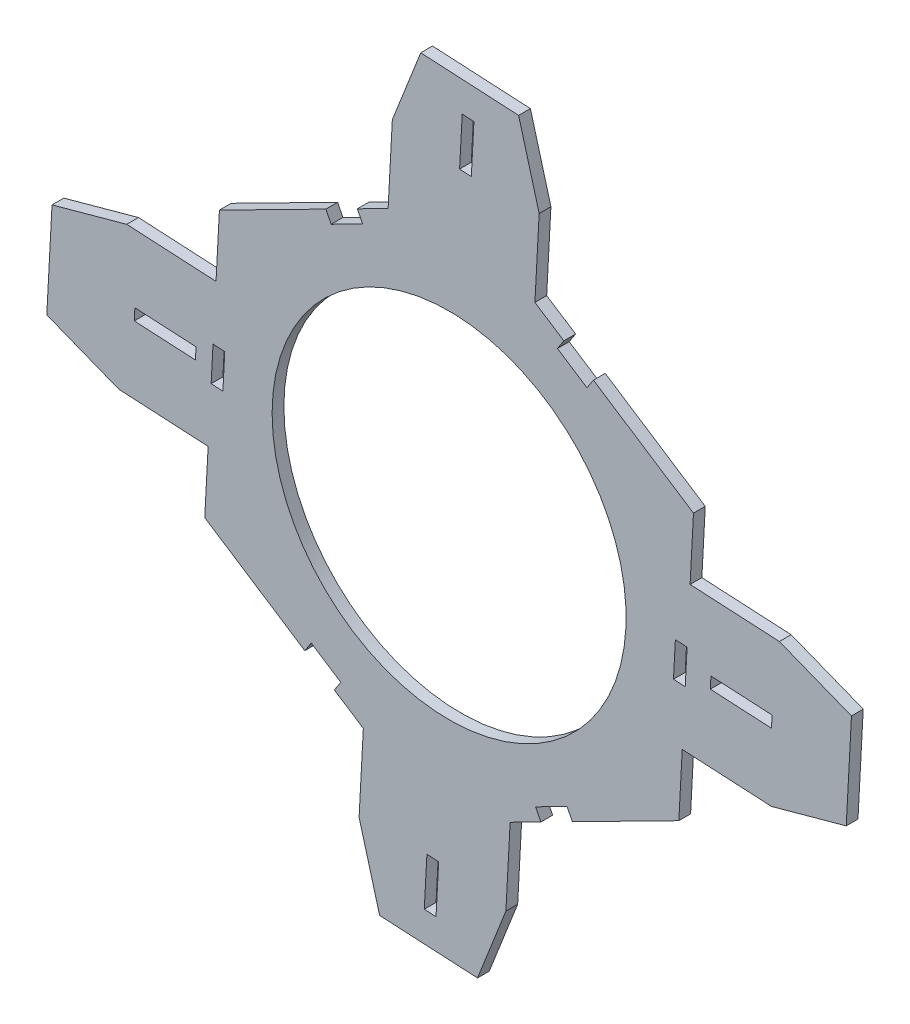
ISO-10303-21;
HEADER;
FILE_DESCRIPTION(('STEP AP214'),'2;1');
FILE_NAME('part.step','',(''),(''),'','','');
FILE_SCHEMA(('AUTOMOTIVE_DESIGN { 1 0 10303 214 1 1 1 1 }'));
ENDSEC;
DATA;
#1=APPLICATION_CONTEXT('core data for automotive mechanical design processes');
#2=APPLICATION_PROTOCOL_DEFINITION('international standard','automotive_design',2000,#1);
#3=PRODUCT_CONTEXT('',#1,'mechanical');
#4=PRODUCT('Part','Part','',(#3));
#5=PRODUCT_RELATED_PRODUCT_CATEGORY('part','',(#4));
#6=PRODUCT_DEFINITION_FORMATION('','',#4);
#7=PRODUCT_DEFINITION_CONTEXT('part definition',#1,'design');
#8=PRODUCT_DEFINITION('design','',#6,#7);
#9=PRODUCT_DEFINITION_SHAPE('','',#8);
#10=(LENGTH_UNIT() NAMED_UNIT(*) SI_UNIT(.MILLI.,.METRE.));
#11=(NAMED_UNIT(*) PLANE_ANGLE_UNIT() SI_UNIT($,.RADIAN.));
#12=(NAMED_UNIT(*) SI_UNIT($,.STERADIAN.) SOLID_ANGLE_UNIT());
#13=UNCERTAINTY_MEASURE_WITH_UNIT(LENGTH_MEASURE(1.E-05),#10,'distance_accuracy_value','');
#14=(GEOMETRIC_REPRESENTATION_CONTEXT(3) GLOBAL_UNCERTAINTY_ASSIGNED_CONTEXT((#13)) GLOBAL_UNIT_ASSIGNED_CONTEXT((#10,
#11,#12)) REPRESENTATION_CONTEXT('',''));
#15=CARTESIAN_POINT('',(0.,0.,0.));
#16=DIRECTION('',(0.,0.,1.));
#17=DIRECTION('',(1.,0.,0.));
#18=AXIS2_PLACEMENT_3D('',#15,#16,#17);
#19=CARTESIAN_POINT('',(57.7650823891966,-3.09490633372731,1.524));
#20=DIRECTION('',(0.998567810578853,-0.0535007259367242,0.));
#21=DIRECTION('',(0.0535007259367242,0.998567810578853,0.));
#22=AXIS2_PLACEMENT_3D('',#19,#20,#21);
#23=PLANE('',#22);
#24=DIRECTION('',(-0.0535007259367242,-0.998567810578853,0.));
#25=VECTOR('',#24,1.);
#26=CARTESIAN_POINT('',(57.7650823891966,-3.09490633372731,0.));
#27=LINE('',#26,#25);
#28=CARTESIAN_POINT('',(57.3054554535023,-11.6736434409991,0.));
#29=VERTEX_POINT('',#28);
#30=CARTESIAN_POINT('',(56.8649975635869,-19.8945986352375,0.));
#31=VERTEX_POINT('',#30);
#32=EDGE_CURVE('E694',#29,#31,#27,.T.);
#33=ORIENTED_EDGE('',*,*,#32,.T.);
#34=DIRECTION('',(0.,0.,-1.));
#35=VECTOR('',#34,1.);
#36=CARTESIAN_POINT('',(56.8649975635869,-19.8945986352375,1.524));
#37=LINE('',#36,#35);
#38=CARTESIAN_POINT('',(56.8649975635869,-19.8945986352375,1.524));
#39=VERTEX_POINT('',#38);
#40=EDGE_CURVE('E854',#39,#31,#37,.T.);
#41=ORIENTED_EDGE('',*,*,#40,.F.);
#42=DIRECTION('',(-0.0535007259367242,-0.998567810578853,0.));
#43=VECTOR('',#42,1.);
#44=CARTESIAN_POINT('',(57.7650823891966,-3.09490633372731,1.524));
#45=LINE('',#44,#43);
#46=CARTESIAN_POINT('',(57.3054554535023,-11.6736434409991,1.524));
#47=VERTEX_POINT('',#46);
#48=EDGE_CURVE('E576',#47,#39,#45,.T.);
#49=ORIENTED_EDGE('',*,*,#48,.F.);
#50=DIRECTION('',(0.,0.,-1.));
#51=VECTOR('',#50,1.);
#52=CARTESIAN_POINT('',(57.3054554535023,-11.6736434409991,1.524));
#53=LINE('',#52,#51);
#54=EDGE_CURVE('E788',#47,#29,#53,.T.);
#55=ORIENTED_EDGE('',*,*,#54,.T.);
#56=EDGE_LOOP('',(#33,#41,#49,#55));
#57=FACE_BOUND('',#56,.T.);
#58=ADVANCED_FACE('F36',(#57),#23,.F.);
#59=CARTESIAN_POINT('',(7.8318605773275,12.0292667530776,1.524));
#60=DIRECTION('',(0.545616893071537,0.838034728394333,0.));
#61=DIRECTION('',(-0.838034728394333,0.545616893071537,0.));
#62=AXIS2_PLACEMENT_3D('',#59,#60,#61);
#63=PLANE('',#62);
#64=DIRECTION('',(0.838034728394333,-0.545616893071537,0.));
#65=VECTOR('',#64,1.);
#66=CARTESIAN_POINT('',(7.8318605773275,12.0292667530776,0.));
#67=LINE('',#66,#65);
#68=CARTESIAN_POINT('',(69.8308580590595,-28.3362446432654,0.));
#69=VERTEX_POINT('',#68);
#70=EDGE_CURVE('E697',#31,#69,#67,.T.);
#71=ORIENTED_EDGE('',*,*,#70,.T.);
#72=DIRECTION('',(0.,0.,-1.));
#73=VECTOR('',#72,1.);
#74=CARTESIAN_POINT('',(69.8308580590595,-28.3362446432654,1.524));
#75=LINE('',#74,#73);
#76=CARTESIAN_POINT('',(69.8308580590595,-28.3362446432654,1.524));
#77=VERTEX_POINT('',#76);
#78=EDGE_CURVE('E851',#77,#69,#75,.T.);
#79=ORIENTED_EDGE('',*,*,#78,.F.);
#80=DIRECTION('',(0.838034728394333,-0.545616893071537,0.));
#81=VECTOR('',#80,1.);
#82=CARTESIAN_POINT('',(7.8318605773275,12.0292667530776,1.524));
#83=LINE('',#82,#81);
#84=EDGE_CURVE('E579',#39,#77,#83,.T.);
#85=ORIENTED_EDGE('',*,*,#84,.F.);
#86=ORIENTED_EDGE('',*,*,#40,.T.);
#87=EDGE_LOOP('',(#71,#79,#85,#86));
#88=FACE_BOUND('',#87,.T.);
#89=ADVANCED_FACE('F1005',(#88),#63,.F.);
#90=CARTESIAN_POINT('',(61.9989974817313,-40.3655113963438,1.524));
#91=DIRECTION('',(-0.838034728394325,0.545616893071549,0.));
#92=DIRECTION('',(-0.545616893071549,-0.838034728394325,0.));
#93=AXIS2_PLACEMENT_3D('',#90,#91,#92);
#94=PLANE('',#93);
#95=DIRECTION('',(0.545616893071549,0.838034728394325,0.));
#96=VECTOR('',#95,1.);
#97=CARTESIAN_POINT('',(61.9989974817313,-40.3655113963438,0.));
#98=LINE('',#97,#96);
#99=CARTESIAN_POINT('',(70.6623782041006,-27.0590797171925,0.));
#100=VERTEX_POINT('',#99);
#101=EDGE_CURVE('E699',#69,#100,#98,.T.);
#102=ORIENTED_EDGE('',*,*,#101,.T.);
#103=DIRECTION('',(0.,0.,-1.));
#104=VECTOR('',#103,1.);
#105=CARTESIAN_POINT('',(70.6623782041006,-27.0590797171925,1.524));
#106=LINE('',#105,#104);
#107=CARTESIAN_POINT('',(70.6623782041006,-27.0590797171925,1.524));
#108=VERTEX_POINT('',#107);
#109=EDGE_CURVE('E849',#108,#100,#106,.T.);
#110=ORIENTED_EDGE('',*,*,#109,.F.);
#111=DIRECTION('',(0.545616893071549,0.838034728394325,0.));
#112=VECTOR('',#111,1.);
#113=CARTESIAN_POINT('',(61.9989974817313,-40.3655113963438,1.524));
#114=LINE('',#113,#112);
#115=EDGE_CURVE('E581',#77,#108,#114,.T.);
#116=ORIENTED_EDGE('',*,*,#115,.F.);
#117=ORIENTED_EDGE('',*,*,#78,.T.);
#118=EDGE_LOOP('',(#102,#110,#116,#117));
#119=FACE_BOUND('',#118,.T.);
#120=ADVANCED_FACE('F1011',(#119),#94,.F.);
#121=CARTESIAN_POINT('',(8.66338072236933,13.3064316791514,1.524));
#122=DIRECTION('',(-0.545616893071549,-0.838034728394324,0.));
#123=DIRECTION('',(0.838034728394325,-0.54561689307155,0.));
#124=AXIS2_PLACEMENT_3D('',#121,#122,#123);
#125=PLANE('',#124);
#126=DIRECTION('',(-0.838034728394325,0.54561689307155,0.));
#127=VECTOR('',#126,1.);
#128=CARTESIAN_POINT('',(8.66338072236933,13.3064316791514,0.));
#129=LINE('',#128,#127);
#130=CARTESIAN_POINT('',(74.4938729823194,-29.5536401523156,0.));
#131=VERTEX_POINT('',#130);
#132=EDGE_CURVE('E702',#131,#100,#129,.T.);
#133=ORIENTED_EDGE('',*,*,#132,.F.);
#134=DIRECTION('',(0.,0.,-1.));
#135=VECTOR('',#134,1.);
#136=CARTESIAN_POINT('',(74.4938729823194,-29.5536401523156,1.524));
#137=LINE('',#136,#135);
#138=CARTESIAN_POINT('',(74.4938729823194,-29.5536401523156,1.524));
#139=VERTEX_POINT('',#138);
#140=EDGE_CURVE('E847',#139,#131,#137,.T.);
#141=ORIENTED_EDGE('',*,*,#140,.F.);
#142=DIRECTION('',(-0.838034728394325,0.54561689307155,0.));
#143=VECTOR('',#142,1.);
#144=CARTESIAN_POINT('',(8.66338072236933,13.3064316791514,1.524));
#145=LINE('',#144,#143);
#146=EDGE_CURVE('E583',#139,#108,#145,.T.);
#147=ORIENTED_EDGE('',*,*,#146,.T.);
#148=ORIENTED_EDGE('',*,*,#109,.T.);
#149=EDGE_LOOP('',(#133,#141,#147,#148));
#150=FACE_BOUND('',#149,.T.);
#151=ADVANCED_FACE('F1242',(#150),#125,.T.);
#152=CARTESIAN_POINT('',(65.8304922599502,-42.8600718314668,1.524));
#153=DIRECTION('',(-0.838034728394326,0.545616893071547,0.));
#154=DIRECTION('',(-0.545616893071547,-0.838034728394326,0.));
#155=AXIS2_PLACEMENT_3D('',#152,#153,#154);
#156=PLANE('',#155);
#157=DIRECTION('',(0.545616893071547,0.838034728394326,0.));
#158=VECTOR('',#157,1.);
#159=CARTESIAN_POINT('',(65.8304922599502,-42.8600718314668,0.));
#160=LINE('',#159,#158);
#161=CARTESIAN_POINT('',(73.6623528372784,-30.8308050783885,0.));
#162=VERTEX_POINT('',#161);
#163=EDGE_CURVE('E705',#162,#131,#160,.T.);
#164=ORIENTED_EDGE('',*,*,#163,.F.);
#165=DIRECTION('',(0.,0.,-1.));
#166=VECTOR('',#165,1.);
#167=CARTESIAN_POINT('',(73.6623528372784,-30.8308050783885,1.524));
#168=LINE('',#167,#166);
#169=CARTESIAN_POINT('',(73.6623528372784,-30.8308050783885,1.524));
#170=VERTEX_POINT('',#169);
#171=EDGE_CURVE('E845',#170,#162,#168,.T.);
#172=ORIENTED_EDGE('',*,*,#171,.F.);
#173=DIRECTION('',(0.545616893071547,0.838034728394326,0.));
#174=VECTOR('',#173,1.);
#175=CARTESIAN_POINT('',(65.8304922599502,-42.8600718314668,1.524));
#176=LINE('',#175,#174);
#177=EDGE_CURVE('E586',#170,#139,#176,.T.);
#178=ORIENTED_EDGE('',*,*,#177,.T.);
#179=ORIENTED_EDGE('',*,*,#140,.T.);
#180=EDGE_LOOP('',(#164,#172,#178,#179));
#181=FACE_BOUND('',#180,.T.);
#182=ADVANCED_FACE('F1246',(#181),#156,.T.);
#183=CARTESIAN_POINT('',(7.83186057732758,12.0292667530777,1.524));
#184=DIRECTION('',(0.545616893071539,0.838034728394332,0.));
#185=DIRECTION('',(-0.838034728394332,0.545616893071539,0.));
#186=AXIS2_PLACEMENT_3D('',#183,#184,#185);
#187=PLANE('',#186);
#188=DIRECTION('',(0.838034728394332,-0.545616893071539,0.));
#189=VECTOR('',#188,1.);
#190=CARTESIAN_POINT('',(7.83186057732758,12.0292667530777,0.));
#191=LINE('',#190,#189);
#192=CARTESIAN_POINT('',(77.4110694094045,-33.2714713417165,0.));
#193=VERTEX_POINT('',#192);
#194=EDGE_CURVE('E708',#162,#193,#191,.T.);
#195=ORIENTED_EDGE('',*,*,#194,.T.);
#196=DIRECTION('',(0.,0.,-1.));
#197=VECTOR('',#196,1.);
#198=CARTESIAN_POINT('',(77.4110694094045,-33.2714713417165,1.524));
#199=LINE('',#198,#197);
#200=CARTESIAN_POINT('',(77.4110694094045,-33.2714713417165,1.524));
#201=VERTEX_POINT('',#200);
#202=EDGE_CURVE('E842',#201,#193,#199,.T.);
#203=ORIENTED_EDGE('',*,*,#202,.F.);
#204=DIRECTION('',(0.838034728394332,-0.545616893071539,0.));
#205=VECTOR('',#204,1.);
#206=CARTESIAN_POINT('',(7.83186057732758,12.0292667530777,1.524));
#207=LINE('',#206,#205);
#208=EDGE_CURVE('E589',#170,#201,#207,.T.);
#209=ORIENTED_EDGE('',*,*,#208,.F.);
#210=ORIENTED_EDGE('',*,*,#171,.T.);
#211=EDGE_LOOP('',(#195,#203,#209,#210));
#212=FACE_BOUND('',#211,.T.);
#213=ADVANCED_FACE('F1251',(#212),#187,.F.);
#214=CARTESIAN_POINT('',(78.9669920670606,-4.23085078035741,1.524));
#215=DIRECTION('',(0.998567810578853,-0.0535007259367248,0.));
#216=DIRECTION('',(0.0535007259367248,0.998567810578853,0.));
#217=AXIS2_PLACEMENT_3D('',#214,#215,#216);
#218=PLANE('',#217);
#219=DIRECTION('',(-0.0535007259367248,-0.998567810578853,0.));
#220=VECTOR('',#219,1.);
#221=CARTESIAN_POINT('',(78.9669920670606,-4.23085078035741,0.));
#222=LINE('',#221,#220);
#223=CARTESIAN_POINT('',(76.8620577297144,-43.5185358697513,0.));
#224=VERTEX_POINT('',#223);
#225=EDGE_CURVE('E710',#193,#224,#222,.T.);
#226=ORIENTED_EDGE('',*,*,#225,.T.);
#227=DIRECTION('',(0.,0.,1.));
#228=VECTOR('',#227,1.);
#229=CARTESIAN_POINT('',(76.8620577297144,-43.5185358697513,1.524));
#230=LINE('',#229,#228);
#231=CARTESIAN_POINT('',(76.8620577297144,-43.5185358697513,1.524));
#232=VERTEX_POINT('',#231);
#233=EDGE_CURVE('E907',#224,#232,#230,.T.);
#234=ORIENTED_EDGE('',*,*,#233,.T.);
#235=DIRECTION('',(-0.0535007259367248,-0.998567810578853,0.));
#236=VECTOR('',#235,1.);
#237=CARTESIAN_POINT('',(78.9669920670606,-4.23085078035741,1.524));
#238=LINE('',#237,#236);
#239=EDGE_CURVE('E591',#201,#232,#238,.T.);
#240=ORIENTED_EDGE('',*,*,#239,.F.);
#241=ORIENTED_EDGE('',*,*,#202,.T.);
#242=EDGE_LOOP('',(#226,#234,#240,#241));
#243=FACE_BOUND('',#242,.T.);
#244=ADVANCED_FACE('F1261',(#243),#218,.F.);
#245=CARTESIAN_POINT('',(-2.61452875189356,-48.7990434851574,1.524));
#246=DIRECTION('',(0.0535007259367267,0.998567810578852,0.));
#247=DIRECTION('',(-0.998567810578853,0.0535007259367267,0.));
#248=AXIS2_PLACEMENT_3D('',#245,#246,#247);
#249=PLANE('',#248);
#250=DIRECTION('',(0.998567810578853,-0.0535007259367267,0.));
#251=VECTOR('',#250,1.);
#252=CARTESIAN_POINT('',(-2.61452875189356,-48.7990434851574,0.));
#253=LINE('',#252,#251);
#254=CARTESIAN_POINT('',(79.5229161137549,-53.199759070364,0.));
#255=VERTEX_POINT('',#254);
#256=CARTESIAN_POINT('',(92.2047273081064,-53.8792182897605,0.));
#257=VERTEX_POINT('',#256);
#258=EDGE_CURVE('E713',#255,#257,#253,.T.);
#259=ORIENTED_EDGE('',*,*,#258,.T.);
#260=DIRECTION('',(0.,0.,1.));
#261=VECTOR('',#260,1.);
#262=CARTESIAN_POINT('',(92.2047273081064,-53.8792182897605,1.524));
#263=LINE('',#262,#261);
#264=CARTESIAN_POINT('',(92.2047273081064,-53.8792182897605,1.524));
#265=VERTEX_POINT('',#264);
#266=EDGE_CURVE('E938',#257,#265,#263,.T.);
#267=ORIENTED_EDGE('',*,*,#266,.T.);
#268=DIRECTION('',(0.998567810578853,-0.0535007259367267,0.));
#269=VECTOR('',#268,1.);
#270=CARTESIAN_POINT('',(-2.61452875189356,-48.7990434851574,1.524));
#271=LINE('',#270,#269);
#272=CARTESIAN_POINT('',(79.5229161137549,-53.1997590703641,1.524));
#273=VERTEX_POINT('',#272);
#274=EDGE_CURVE('E594',#273,#265,#271,.T.);
#275=ORIENTED_EDGE('',*,*,#274,.F.);
#276=DIRECTION('',(0.,0.,-1.));
#277=VECTOR('',#276,1.);
#278=CARTESIAN_POINT('',(79.5229161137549,-53.199759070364,1.524));
#279=LINE('',#278,#277);
#280=EDGE_CURVE('E904',#273,#255,#279,.T.);
#281=ORIENTED_EDGE('',*,*,#280,.T.);
#282=EDGE_LOOP('',(#259,#267,#275,#281));
#283=FACE_BOUND('',#282,.T.);
#284=ADVANCED_FACE('F1259',(#283),#249,.F.);
#285=CARTESIAN_POINT('',(97.9897088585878,-5.25003960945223,1.524));
#286=DIRECTION('',(0.998567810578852,-0.0535007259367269,0.));
#287=DIRECTION('',(0.0535007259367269,0.998567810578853,0.));
#288=AXIS2_PLACEMENT_3D('',#285,#286,#287);
#289=PLANE('',#288);
#290=DIRECTION('',(-0.0535007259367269,-0.998567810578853,0.));
#291=VECTOR('',#290,1.);
#292=CARTESIAN_POINT('',(97.9897088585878,-5.25003960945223,1.524));
#293=LINE('',#292,#291);
#294=CARTESIAN_POINT('',(96.4337862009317,-34.2906601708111,1.524));
#295=VERTEX_POINT('',#294);
#296=CARTESIAN_POINT('',(95.8847745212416,-44.5377246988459,1.524));
#297=VERTEX_POINT('',#296);
#298=EDGE_CURVE('E597',#295,#297,#293,.T.);
#299=ORIENTED_EDGE('',*,*,#298,.T.);
#300=DIRECTION('',(0.,0.,-1.));
#301=VECTOR('',#300,1.);
#302=CARTESIAN_POINT('',(95.8847745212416,-44.5377246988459,0.));
#303=LINE('',#302,#301);
#304=CARTESIAN_POINT('',(95.8847745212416,-44.5377246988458,0.));
#305=VERTEX_POINT('',#304);
#306=EDGE_CURVE('E935',#297,#305,#303,.T.);
#307=ORIENTED_EDGE('',*,*,#306,.T.);
#308=DIRECTION('',(-0.0535007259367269,-0.998567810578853,0.));
#309=VECTOR('',#308,1.);
#310=CARTESIAN_POINT('',(97.9897088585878,-5.25003960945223,0.));
#311=LINE('',#310,#309);
#312=CARTESIAN_POINT('',(96.4337862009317,-34.2906601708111,0.));
#313=VERTEX_POINT('',#312);
#314=EDGE_CURVE('E716',#313,#305,#311,.T.);
#315=ORIENTED_EDGE('',*,*,#314,.F.);
#316=DIRECTION('',(0.,0.,-1.));
#317=VECTOR('',#316,1.);
#318=CARTESIAN_POINT('',(96.4337862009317,-34.2906601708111,1.524));
#319=LINE('',#318,#317);
#320=EDGE_CURVE('E840',#295,#313,#319,.T.);
#321=ORIENTED_EDGE('',*,*,#320,.F.);
#322=EDGE_LOOP('',(#299,#307,#315,#321));
#323=FACE_BOUND('',#322,.T.);
#324=ADVANCED_FACE('F1093',(#323),#289,.T.);
#325=CARTESIAN_POINT('',(33.6321089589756,-66.1974981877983,1.524));
#326=DIRECTION('',(-0.452950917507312,0.891535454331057,0.));
#327=DIRECTION('',(-0.891535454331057,-0.452950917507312,0.));
#328=AXIS2_PLACEMENT_3D('',#325,#326,#327);
#329=PLANE('',#328);
#330=DIRECTION('',(0.891535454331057,0.452950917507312,0.));
#331=VECTOR('',#330,1.);
#332=CARTESIAN_POINT('',(33.6321089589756,-66.1974981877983,0.));
#333=LINE('',#332,#331);
#334=CARTESIAN_POINT('',(100.421823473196,-32.2645095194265,0.));
#335=VERTEX_POINT('',#334);
#336=EDGE_CURVE('E719',#313,#335,#333,.T.);
#337=ORIENTED_EDGE('',*,*,#336,.T.);
#338=DIRECTION('',(0.,0.,-1.));
#339=VECTOR('',#338,1.);
#340=CARTESIAN_POINT('',(100.421823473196,-32.2645095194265,1.524));
#341=LINE('',#340,#339);
#342=CARTESIAN_POINT('',(100.421823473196,-32.2645095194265,1.524));
#343=VERTEX_POINT('',#342);
#344=EDGE_CURVE('E837',#343,#335,#341,.T.);
#345=ORIENTED_EDGE('',*,*,#344,.F.);
#346=DIRECTION('',(0.891535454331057,0.452950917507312,0.));
#347=VECTOR('',#346,1.);
#348=CARTESIAN_POINT('',(33.6321089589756,-66.1974981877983,1.524));
#349=LINE('',#348,#347);
#350=EDGE_CURVE('E600',#295,#343,#349,.T.);
#351=ORIENTED_EDGE('',*,*,#350,.F.);
#352=ORIENTED_EDGE('',*,*,#320,.T.);
#353=EDGE_LOOP('',(#337,#345,#351,#352));
#354=FACE_BOUND('',#353,.T.);
#355=ADVANCED_FACE('F1099',(#354),#329,.F.);
#356=CARTESIAN_POINT('',(66.7897145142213,33.9329886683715,1.524));
#357=DIRECTION('',(-0.891535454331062,-0.452950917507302,0.));
#358=DIRECTION('',(0.452950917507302,-0.891535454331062,0.));
#359=AXIS2_PLACEMENT_3D('',#356,#357,#358);
#360=PLANE('',#359);
#361=DIRECTION('',(-0.452950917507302,0.891535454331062,0.));
#362=VECTOR('',#361,1.);
#363=CARTESIAN_POINT('',(66.7897145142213,33.9329886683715,0.));
#364=LINE('',#363,#362);
#365=CARTESIAN_POINT('',(99.7315262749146,-30.9058094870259,0.));
#366=VERTEX_POINT('',#365);
#367=EDGE_CURVE('E721',#335,#366,#364,.T.);
#368=ORIENTED_EDGE('',*,*,#367,.T.);
#369=DIRECTION('',(0.,0.,-1.));
#370=VECTOR('',#369,1.);
#371=CARTESIAN_POINT('',(99.7315262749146,-30.9058094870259,1.524));
#372=LINE('',#371,#370);
#373=CARTESIAN_POINT('',(99.7315262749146,-30.9058094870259,1.524));
#374=VERTEX_POINT('',#373);
#375=EDGE_CURVE('E835',#374,#366,#372,.T.);
#376=ORIENTED_EDGE('',*,*,#375,.F.);
#377=DIRECTION('',(-0.452950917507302,0.891535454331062,0.));
#378=VECTOR('',#377,1.);
#379=CARTESIAN_POINT('',(66.7897145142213,33.9329886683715,1.524));
#380=LINE('',#379,#378);
#381=EDGE_CURVE('E602',#343,#374,#380,.T.);
#382=ORIENTED_EDGE('',*,*,#381,.F.);
#383=ORIENTED_EDGE('',*,*,#344,.T.);
#384=EDGE_LOOP('',(#368,#376,#382,#383));
#385=FACE_BOUND('',#384,.T.);
#386=ADVANCED_FACE('F1105',(#385),#360,.F.);
#387=CARTESIAN_POINT('',(32.9418117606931,-64.8387981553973,1.524));
#388=DIRECTION('',(0.452950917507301,-0.891535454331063,0.));
#389=DIRECTION('',(0.891535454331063,0.452950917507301,0.));
#390=AXIS2_PLACEMENT_3D('',#387,#388,#389);
#391=PLANE('',#390);
#392=DIRECTION('',(-0.891535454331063,-0.452950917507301,0.));
#393=VECTOR('',#392,1.);
#394=CARTESIAN_POINT('',(32.9418117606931,-64.8387981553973,0.));
#395=LINE('',#394,#393);
#396=CARTESIAN_POINT('',(103.807626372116,-28.8349178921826,0.));
#397=VERTEX_POINT('',#396);
#398=EDGE_CURVE('E724',#397,#366,#395,.T.);
#399=ORIENTED_EDGE('',*,*,#398,.F.);
#400=DIRECTION('',(0.,0.,-1.));
#401=VECTOR('',#400,1.);
#402=CARTESIAN_POINT('',(103.807626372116,-28.8349178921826,1.524));
#403=LINE('',#402,#401);
#404=CARTESIAN_POINT('',(103.807626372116,-28.8349178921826,1.524));
#405=VERTEX_POINT('',#404);
#406=EDGE_CURVE('E833',#405,#397,#403,.T.);
#407=ORIENTED_EDGE('',*,*,#406,.F.);
#408=DIRECTION('',(-0.891535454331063,-0.452950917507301,0.));
#409=VECTOR('',#408,1.);
#410=CARTESIAN_POINT('',(32.9418117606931,-64.8387981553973,1.524));
#411=LINE('',#410,#409);
#412=EDGE_CURVE('E604',#405,#374,#411,.T.);
#413=ORIENTED_EDGE('',*,*,#412,.T.);
#414=ORIENTED_EDGE('',*,*,#375,.T.);
#415=EDGE_LOOP('',(#399,#407,#413,#414));
#416=FACE_BOUND('',#415,.T.);
#417=ADVANCED_FACE('F1109',(#416),#391,.T.);
#418=CARTESIAN_POINT('',(70.8658146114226,36.0038802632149,1.524));
#419=DIRECTION('',(-0.891535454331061,-0.452950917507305,0.));
#420=DIRECTION('',(0.452950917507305,-0.891535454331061,0.));
#421=AXIS2_PLACEMENT_3D('',#418,#419,#420);
#422=PLANE('',#421);
#423=DIRECTION('',(-0.452950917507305,0.891535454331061,0.));
#424=VECTOR('',#423,1.);
#425=CARTESIAN_POINT('',(70.8658146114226,36.0038802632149,0.));
#426=LINE('',#425,#424);
#427=CARTESIAN_POINT('',(104.497923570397,-30.193617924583,0.));
#428=VERTEX_POINT('',#427);
#429=EDGE_CURVE('E727',#428,#397,#426,.T.);
#430=ORIENTED_EDGE('',*,*,#429,.F.);
#431=DIRECTION('',(0.,0.,-1.));
#432=VECTOR('',#431,1.);
#433=CARTESIAN_POINT('',(104.497923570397,-30.193617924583,1.524));
#434=LINE('',#433,#432);
#435=CARTESIAN_POINT('',(104.497923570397,-30.193617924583,1.524));
#436=VERTEX_POINT('',#435);
#437=EDGE_CURVE('E831',#436,#428,#434,.T.);
#438=ORIENTED_EDGE('',*,*,#437,.F.);
#439=DIRECTION('',(-0.452950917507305,0.891535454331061,0.));
#440=VECTOR('',#439,1.);
#441=CARTESIAN_POINT('',(70.8658146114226,36.0038802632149,1.524));
#442=LINE('',#441,#440);
#443=EDGE_CURVE('E607',#436,#405,#442,.T.);
#444=ORIENTED_EDGE('',*,*,#443,.T.);
#445=ORIENTED_EDGE('',*,*,#406,.T.);
#446=EDGE_LOOP('',(#430,#438,#444,#445));
#447=FACE_BOUND('',#446,.T.);
#448=ADVANCED_FACE('F1112',(#447),#422,.T.);
#449=CARTESIAN_POINT('',(33.6321089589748,-66.197498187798,1.524));
#450=DIRECTION('',(-0.452950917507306,0.89153545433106,0.));
#451=DIRECTION('',(-0.89153545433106,-0.452950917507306,0.));
#452=AXIS2_PLACEMENT_3D('',#449,#450,#451);
#453=PLANE('',#452);
#454=DIRECTION('',(0.89153545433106,0.452950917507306,0.));
#455=VECTOR('',#454,1.);
#456=CARTESIAN_POINT('',(33.6321089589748,-66.197498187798,0.));
#457=LINE('',#456,#455);
#458=CARTESIAN_POINT('',(118.291533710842,-23.1856763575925,0.));
#459=VERTEX_POINT('',#458);
#460=EDGE_CURVE('E730',#428,#459,#457,.T.);
#461=ORIENTED_EDGE('',*,*,#460,.T.);
#462=DIRECTION('',(0.,0.,-1.));
#463=VECTOR('',#462,1.);
#464=CARTESIAN_POINT('',(118.291533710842,-23.1856763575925,1.524));
#465=LINE('',#464,#463);
#466=CARTESIAN_POINT('',(118.291533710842,-23.1856763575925,1.524));
#467=VERTEX_POINT('',#466);
#468=EDGE_CURVE('E828',#467,#459,#465,.T.);
#469=ORIENTED_EDGE('',*,*,#468,.F.);
#470=DIRECTION('',(0.89153545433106,0.452950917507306,0.));
#471=VECTOR('',#470,1.);
#472=CARTESIAN_POINT('',(33.6321089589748,-66.197498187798,1.524));
#473=LINE('',#472,#471);
#474=EDGE_CURVE('E610',#436,#467,#473,.T.);
#475=ORIENTED_EDGE('',*,*,#474,.F.);
#476=ORIENTED_EDGE('',*,*,#437,.T.);
#477=EDGE_LOOP('',(#461,#469,#475,#476));
#478=FACE_BOUND('',#477,.T.);
#479=ADVANCED_FACE('F1118',(#478),#453,.F.);
#480=CARTESIAN_POINT('',(119.191618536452,-6.38598405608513,1.524));
#481=DIRECTION('',(-0.998567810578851,0.0535007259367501,0.));
#482=DIRECTION('',(-0.0535007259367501,-0.998567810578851,0.));
#483=AXIS2_PLACEMENT_3D('',#480,#481,#482);
#484=PLANE('',#483);
#485=DIRECTION('',(0.0535007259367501,0.998567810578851,0.));
#486=VECTOR('',#485,1.);
#487=CARTESIAN_POINT('',(119.191618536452,-6.38598405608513,0.));
#488=LINE('',#487,#486);
#489=CARTESIAN_POINT('',(118.731991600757,-14.9647211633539,0.));
#490=VERTEX_POINT('',#489);
#491=EDGE_CURVE('E732',#459,#490,#488,.T.);
#492=ORIENTED_EDGE('',*,*,#491,.T.);
#493=DIRECTION('',(0.,0.,-1.));
#494=VECTOR('',#493,1.);
#495=CARTESIAN_POINT('',(118.731991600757,-14.9647211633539,1.524));
#496=LINE('',#495,#494);
#497=CARTESIAN_POINT('',(118.731991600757,-14.9647211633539,1.524));
#498=VERTEX_POINT('',#497);
#499=EDGE_CURVE('E825',#498,#490,#496,.T.);
#500=ORIENTED_EDGE('',*,*,#499,.F.);
#501=DIRECTION('',(0.0535007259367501,0.998567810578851,0.));
#502=VECTOR('',#501,1.);
#503=CARTESIAN_POINT('',(119.191618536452,-6.38598405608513,1.524));
#504=LINE('',#503,#502);
#505=EDGE_CURVE('E612',#467,#498,#504,.T.);
#506=ORIENTED_EDGE('',*,*,#505,.F.);
#507=ORIENTED_EDGE('',*,*,#468,.T.);
#508=EDGE_LOOP('',(#492,#500,#506,#507));
#509=FACE_BOUND('',#508,.T.);
#510=ADVANCED_FACE('F1122',(#509),#484,.F.);
#511=CARTESIAN_POINT('',(-0.459626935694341,-8.57873710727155,1.524));
#512=DIRECTION('',(0.0535007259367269,0.998567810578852,0.));
#513=DIRECTION('',(-0.998567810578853,0.0535007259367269,0.));
#514=AXIS2_PLACEMENT_3D('',#511,#512,#513);
#515=PLANE('',#514);
#516=DIRECTION('',(0.998567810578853,-0.0535007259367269,0.));
#517=VECTOR('',#516,1.);
#518=CARTESIAN_POINT('',(-0.459626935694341,-8.57873710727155,0.));
#519=LINE('',#518,#517);
#520=CARTESIAN_POINT('',(130.300286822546,-15.584521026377,0.));
#521=VERTEX_POINT('',#520);
#522=EDGE_CURVE('E734',#490,#521,#519,.T.);
#523=ORIENTED_EDGE('',*,*,#522,.T.);
#524=DIRECTION('',(0.,0.,1.));
#525=VECTOR('',#524,1.);
#526=CARTESIAN_POINT('',(130.300286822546,-15.584521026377,1.524));
#527=LINE('',#526,#525);
#528=CARTESIAN_POINT('',(130.300286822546,-15.584521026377,1.524));
#529=VERTEX_POINT('',#528);
#530=EDGE_CURVE('E902',#521,#529,#527,.T.);
#531=ORIENTED_EDGE('',*,*,#530,.T.);
#532=DIRECTION('',(0.998567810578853,-0.0535007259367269,0.));
#533=VECTOR('',#532,1.);
#534=CARTESIAN_POINT('',(-0.459626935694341,-8.57873710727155,1.524));
#535=LINE('',#534,#533);
#536=EDGE_CURVE('E614',#498,#529,#535,.T.);
#537=ORIENTED_EDGE('',*,*,#536,.F.);
#538=ORIENTED_EDGE('',*,*,#499,.T.);
#539=EDGE_LOOP('',(#523,#531,#537,#538));
#540=FACE_BOUND('',#539,.T.);
#541=ADVANCED_FACE('F1126',(#540),#515,.F.);
#542=CARTESIAN_POINT('',(140.271272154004,-7.51537833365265,1.524));
#543=DIRECTION('',(0.998567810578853,-0.053500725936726,0.));
#544=DIRECTION('',(0.053500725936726,0.998567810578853,0.));
#545=AXIS2_PLACEMENT_3D('',#542,#543,#544);
#546=PLANE('',#545);
#547=DIRECTION('',(-0.053500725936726,-0.998567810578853,0.));
#548=VECTOR('',#547,1.);
#549=CARTESIAN_POINT('',(140.271272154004,-7.51537833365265,0.));
#550=LINE('',#549,#548);
#551=CARTESIAN_POINT('',(140.660969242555,-0.241851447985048,0.));
#552=VERTEX_POINT('',#551);
#553=CARTESIAN_POINT('',(139.981510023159,-12.9236626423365,0.));
#554=VERTEX_POINT('',#553);
#555=EDGE_CURVE('E737',#552,#554,#550,.T.);
#556=ORIENTED_EDGE('',*,*,#555,.F.);
#557=DIRECTION('',(0.,0.,1.));
#558=VECTOR('',#557,1.);
#559=CARTESIAN_POINT('',(140.660969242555,-0.24185144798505,1.524));
#560=LINE('',#559,#558);
#561=CARTESIAN_POINT('',(140.660969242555,-0.241851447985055,1.524));
#562=VERTEX_POINT('',#561);
#563=EDGE_CURVE('E933',#552,#562,#560,.T.);
#564=ORIENTED_EDGE('',*,*,#563,.T.);
#565=DIRECTION('',(-0.053500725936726,-0.998567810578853,0.));
#566=VECTOR('',#565,1.);
#567=CARTESIAN_POINT('',(140.271272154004,-7.51537833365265,1.524));
#568=LINE('',#567,#566);
#569=CARTESIAN_POINT('',(139.981510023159,-12.9236626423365,1.524));
#570=VERTEX_POINT('',#569);
#571=EDGE_CURVE('E617',#562,#570,#568,.T.);
#572=ORIENTED_EDGE('',*,*,#571,.T.);
#573=DIRECTION('',(0.,0.,-1.));
#574=VECTOR('',#573,1.);
#575=CARTESIAN_POINT('',(139.981510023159,-12.9236626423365,0.));
#576=LINE('',#575,#574);
#577=EDGE_CURVE('E899',#570,#554,#576,.T.);
#578=ORIENTED_EDGE('',*,*,#577,.T.);
#579=EDGE_LOOP('',(#556,#564,#572,#578));
#580=FACE_BOUND('',#579,.T.);
#581=ADVANCED_FACE('F1134',(#580),#546,.T.);
#582=CARTESIAN_POINT('',(0.559561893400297,10.4439796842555,1.524));
#583=DIRECTION('',(0.0535007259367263,0.998567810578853,0.));
#584=DIRECTION('',(-0.998567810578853,0.0535007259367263,0.));
#585=AXIS2_PLACEMENT_3D('',#582,#583,#584);
#586=PLANE('',#585);
#587=DIRECTION('',(0.998567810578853,-0.0535007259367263,0.));
#588=VECTOR('',#587,1.);
#589=CARTESIAN_POINT('',(0.559561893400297,10.4439796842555,1.524));
#590=LINE('',#589,#588);
#591=CARTESIAN_POINT('',(119.751180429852,4.05799562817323,1.524));
#592=VERTEX_POINT('',#591);
#593=CARTESIAN_POINT('',(131.319475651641,3.43819576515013,1.524));
#594=VERTEX_POINT('',#593);
#595=EDGE_CURVE('E619',#592,#594,#590,.T.);
#596=ORIENTED_EDGE('',*,*,#595,.T.);
#597=DIRECTION('',(0.,0.,-1.));
#598=VECTOR('',#597,1.);
#599=CARTESIAN_POINT('',(131.319475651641,3.43819576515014,1.524));
#600=LINE('',#599,#598);
#601=CARTESIAN_POINT('',(131.319475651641,3.43819576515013,0.));
#602=VERTEX_POINT('',#601);
#603=EDGE_CURVE('E930',#594,#602,#600,.T.);
#604=ORIENTED_EDGE('',*,*,#603,.T.);
#605=DIRECTION('',(0.998567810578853,-0.0535007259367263,0.));
#606=VECTOR('',#605,1.);
#607=CARTESIAN_POINT('',(0.559561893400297,10.4439796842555,0.));
#608=LINE('',#607,#606);
#609=CARTESIAN_POINT('',(119.751180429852,4.05799562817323,0.));
#610=VERTEX_POINT('',#609);
#611=EDGE_CURVE('E739',#610,#602,#608,.T.);
#612=ORIENTED_EDGE('',*,*,#611,.F.);
#613=DIRECTION('',(0.,0.,-1.));
#614=VECTOR('',#613,1.);
#615=CARTESIAN_POINT('',(119.751180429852,4.05799562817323,1.524));
#616=LINE('',#615,#614);
#617=EDGE_CURVE('E823',#592,#610,#616,.T.);
#618=ORIENTED_EDGE('',*,*,#617,.F.);
#619=EDGE_LOOP('',(#596,#604,#612,#618));
#620=FACE_BOUND('',#619,.T.);
#621=ADVANCED_FACE('F1141',(#620),#586,.T.);
#622=CARTESIAN_POINT('',(119.191618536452,-6.38598405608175,1.524));
#623=DIRECTION('',(-0.998567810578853,0.0535007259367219,0.));
#624=DIRECTION('',(-0.0535007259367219,-0.998567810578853,0.));
#625=AXIS2_PLACEMENT_3D('',#622,#623,#624);
#626=PLANE('',#625);
#627=DIRECTION('',(0.0535007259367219,0.998567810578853,0.));
#628=VECTOR('',#627,1.);
#629=CARTESIAN_POINT('',(119.191618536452,-6.38598405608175,0.));
#630=LINE('',#629,#628);
#631=CARTESIAN_POINT('',(120.191638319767,12.2789508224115,0.));
#632=VERTEX_POINT('',#631);
#633=EDGE_CURVE('E742',#610,#632,#630,.T.);
#634=ORIENTED_EDGE('',*,*,#633,.T.);
#635=DIRECTION('',(0.,0.,-1.));
#636=VECTOR('',#635,1.);
#637=CARTESIAN_POINT('',(120.191638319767,12.2789508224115,1.524));
#638=LINE('',#637,#636);
#639=CARTESIAN_POINT('',(120.191638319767,12.2789508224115,1.524));
#640=VERTEX_POINT('',#639);
#641=EDGE_CURVE('E820',#640,#632,#638,.T.);
#642=ORIENTED_EDGE('',*,*,#641,.F.);
#643=DIRECTION('',(0.0535007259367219,0.998567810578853,0.));
#644=VECTOR('',#643,1.);
#645=CARTESIAN_POINT('',(119.191618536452,-6.38598405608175,1.524));
#646=LINE('',#645,#644);
#647=EDGE_CURVE('E622',#592,#640,#646,.T.);
#648=ORIENTED_EDGE('',*,*,#647,.F.);
#649=ORIENTED_EDGE('',*,*,#617,.T.);
#650=EDGE_LOOP('',(#634,#642,#648,#649));
#651=FACE_BOUND('',#650,.T.);
#652=ADVANCED_FACE('F1148',(#651),#626,.F.);
#653=CARTESIAN_POINT('',(41.3952855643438,63.5806686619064,1.524));
#654=DIRECTION('',(-0.545616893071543,-0.838034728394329,0.));
#655=DIRECTION('',(0.838034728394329,-0.545616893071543,0.));
#656=AXIS2_PLACEMENT_3D('',#653,#654,#655);
#657=PLANE('',#656);
#658=DIRECTION('',(-0.838034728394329,0.545616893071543,0.));
#659=VECTOR('',#658,1.);
#660=CARTESIAN_POINT('',(41.3952855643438,63.5806686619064,0.));
#661=LINE('',#660,#659);
#662=CARTESIAN_POINT('',(107.225777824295,20.7205968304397,0.));
#663=VERTEX_POINT('',#662);
#664=EDGE_CURVE('E744',#632,#663,#661,.T.);
#665=ORIENTED_EDGE('',*,*,#664,.T.);
#666=DIRECTION('',(0.,0.,-1.));
#667=VECTOR('',#666,1.);
#668=CARTESIAN_POINT('',(107.225777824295,20.7205968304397,1.524));
#669=LINE('',#668,#667);
#670=CARTESIAN_POINT('',(107.225777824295,20.7205968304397,1.524));
#671=VERTEX_POINT('',#670);
#672=EDGE_CURVE('E817',#671,#663,#669,.T.);
#673=ORIENTED_EDGE('',*,*,#672,.F.);
#674=DIRECTION('',(-0.838034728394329,0.545616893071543,0.));
#675=VECTOR('',#674,1.);
#676=CARTESIAN_POINT('',(41.3952855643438,63.5806686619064,1.524));
#677=LINE('',#676,#675);
#678=EDGE_CURVE('E624',#640,#671,#677,.T.);
#679=ORIENTED_EDGE('',*,*,#678,.F.);
#680=ORIENTED_EDGE('',*,*,#641,.T.);
#681=EDGE_LOOP('',(#665,#673,#679,#680));
#682=FACE_BOUND('',#681,.T.);
#683=ADVANCED_FACE('F1152',(#682),#657,.F.);
#684=CARTESIAN_POINT('',(65.830492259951,-42.8600718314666,1.524));
#685=DIRECTION('',(0.83803472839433,-0.545616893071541,0.));
#686=DIRECTION('',(0.545616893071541,0.83803472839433,0.));
#687=AXIS2_PLACEMENT_3D('',#684,#685,#686);
#688=PLANE('',#687);
#689=DIRECTION('',(-0.545616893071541,-0.83803472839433,0.));
#690=VECTOR('',#689,1.);
#691=CARTESIAN_POINT('',(65.830492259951,-42.8600718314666,0.));
#692=LINE('',#691,#690);
#693=CARTESIAN_POINT('',(106.394257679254,19.4434319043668,0.));
#694=VERTEX_POINT('',#693);
#695=EDGE_CURVE('E746',#663,#694,#692,.T.);
#696=ORIENTED_EDGE('',*,*,#695,.T.);
#697=DIRECTION('',(0.,0.,-1.));
#698=VECTOR('',#697,1.);
#699=CARTESIAN_POINT('',(106.394257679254,19.4434319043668,1.524));
#700=LINE('',#699,#698);
#701=CARTESIAN_POINT('',(106.394257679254,19.4434319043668,1.524));
#702=VERTEX_POINT('',#701);
#703=EDGE_CURVE('E815',#702,#694,#700,.T.);
#704=ORIENTED_EDGE('',*,*,#703,.F.);
#705=DIRECTION('',(-0.545616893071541,-0.83803472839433,0.));
#706=VECTOR('',#705,1.);
#707=CARTESIAN_POINT('',(65.830492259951,-42.8600718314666,1.524));
#708=LINE('',#707,#706);
#709=EDGE_CURVE('E626',#671,#702,#708,.T.);
#710=ORIENTED_EDGE('',*,*,#709,.F.);
#711=ORIENTED_EDGE('',*,*,#672,.T.);
#712=EDGE_LOOP('',(#696,#704,#710,#711));
#713=FACE_BOUND('',#712,.T.);
#714=ADVANCED_FACE('F1159',(#713),#688,.F.);
#715=CARTESIAN_POINT('',(40.5637654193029,62.3035037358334,1.524));
#716=DIRECTION('',(0.545616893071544,0.838034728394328,0.));
#717=DIRECTION('',(-0.838034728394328,0.545616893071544,0.));
#718=AXIS2_PLACEMENT_3D('',#715,#716,#717);
#719=PLANE('',#718);
#720=DIRECTION('',(0.838034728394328,-0.545616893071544,0.));
#721=VECTOR('',#720,1.);
#722=CARTESIAN_POINT('',(40.5637654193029,62.3035037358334,0.));
#723=LINE('',#722,#721);
#724=CARTESIAN_POINT('',(102.562762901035,21.9379923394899,0.));
#725=VERTEX_POINT('',#724);
#726=EDGE_CURVE('E749',#725,#694,#723,.T.);
#727=ORIENTED_EDGE('',*,*,#726,.F.);
#728=DIRECTION('',(0.,0.,-1.));
#729=VECTOR('',#728,1.);
#730=CARTESIAN_POINT('',(102.562762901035,21.9379923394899,1.524));
#731=LINE('',#730,#729);
#732=CARTESIAN_POINT('',(102.562762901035,21.9379923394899,1.524));
#733=VERTEX_POINT('',#732);
#734=EDGE_CURVE('E813',#733,#725,#731,.T.);
#735=ORIENTED_EDGE('',*,*,#734,.F.);
#736=DIRECTION('',(0.838034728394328,-0.545616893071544,0.));
#737=VECTOR('',#736,1.);
#738=CARTESIAN_POINT('',(40.5637654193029,62.3035037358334,1.524));
#739=LINE('',#738,#737);
#740=EDGE_CURVE('E628',#733,#702,#739,.T.);
#741=ORIENTED_EDGE('',*,*,#740,.T.);
#742=ORIENTED_EDGE('',*,*,#703,.T.);
#743=EDGE_LOOP('',(#727,#735,#741,#742));
#744=FACE_BOUND('',#743,.T.);
#745=ADVANCED_FACE('F1162',(#744),#719,.T.);
#746=CARTESIAN_POINT('',(61.9989974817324,-40.3655113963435,1.524));
#747=DIRECTION('',(0.838034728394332,-0.545616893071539,0.));
#748=DIRECTION('',(0.545616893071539,0.838034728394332,0.));
#749=AXIS2_PLACEMENT_3D('',#746,#747,#748);
#750=PLANE('',#749);
#751=DIRECTION('',(-0.545616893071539,-0.838034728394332,0.));
#752=VECTOR('',#751,1.);
#753=CARTESIAN_POINT('',(61.9989974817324,-40.3655113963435,0.));
#754=LINE('',#753,#752);
#755=CARTESIAN_POINT('',(103.394283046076,23.2151572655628,0.));
#756=VERTEX_POINT('',#755);
#757=EDGE_CURVE('E752',#756,#725,#754,.T.);
#758=ORIENTED_EDGE('',*,*,#757,.F.);
#759=DIRECTION('',(0.,0.,-1.));
#760=VECTOR('',#759,1.);
#761=CARTESIAN_POINT('',(103.394283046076,23.2151572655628,1.524));
#762=LINE('',#761,#760);
#763=CARTESIAN_POINT('',(103.394283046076,23.2151572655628,1.524));
#764=VERTEX_POINT('',#763);
#765=EDGE_CURVE('E811',#764,#756,#762,.T.);
#766=ORIENTED_EDGE('',*,*,#765,.F.);
#767=DIRECTION('',(-0.545616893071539,-0.838034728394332,0.));
#768=VECTOR('',#767,1.);
#769=CARTESIAN_POINT('',(61.9989974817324,-40.3655113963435,1.524));
#770=LINE('',#769,#768);
#771=EDGE_CURVE('E631',#764,#733,#770,.T.);
#772=ORIENTED_EDGE('',*,*,#771,.T.);
#773=ORIENTED_EDGE('',*,*,#734,.T.);
#774=EDGE_LOOP('',(#758,#766,#772,#773));
#775=FACE_BOUND('',#774,.T.);
#776=ADVANCED_FACE('F1165',(#775),#750,.T.);
#777=CARTESIAN_POINT('',(41.3952855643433,63.5806686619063,1.524));
#778=DIRECTION('',(-0.545616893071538,-0.838034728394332,0.));
#779=DIRECTION('',(0.838034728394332,-0.545616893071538,0.));
#780=AXIS2_PLACEMENT_3D('',#777,#778,#779);
#781=PLANE('',#780);
#782=DIRECTION('',(-0.838034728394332,0.545616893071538,0.));
#783=VECTOR('',#782,1.);
#784=CARTESIAN_POINT('',(41.3952855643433,63.5806686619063,0.));
#785=LINE('',#784,#783);
#786=CARTESIAN_POINT('',(99.6455664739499,25.6558235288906,0.));
#787=VERTEX_POINT('',#786);
#788=EDGE_CURVE('E755',#756,#787,#785,.T.);
#789=ORIENTED_EDGE('',*,*,#788,.T.);
#790=DIRECTION('',(0.,0.,-1.));
#791=VECTOR('',#790,1.);
#792=CARTESIAN_POINT('',(99.6455664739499,25.6558235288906,1.524));
#793=LINE('',#792,#791);
#794=CARTESIAN_POINT('',(99.6455664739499,25.6558235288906,1.524));
#795=VERTEX_POINT('',#794);
#796=EDGE_CURVE('E808',#795,#787,#793,.T.);
#797=ORIENTED_EDGE('',*,*,#796,.F.);
#798=DIRECTION('',(-0.838034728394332,0.545616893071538,0.));
#799=VECTOR('',#798,1.);
#800=CARTESIAN_POINT('',(41.3952855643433,63.5806686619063,1.524));
#801=LINE('',#800,#799);
#802=EDGE_CURVE('E634',#764,#795,#801,.T.);
#803=ORIENTED_EDGE('',*,*,#802,.F.);
#804=ORIENTED_EDGE('',*,*,#765,.T.);
#805=EDGE_LOOP('',(#789,#797,#803,#804));
#806=FACE_BOUND('',#805,.T.);
#807=ADVANCED_FACE('F1171',(#806),#781,.F.);
#808=CARTESIAN_POINT('',(97.9897088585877,-5.25003960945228,1.524));
#809=DIRECTION('',(-0.998567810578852,0.0535007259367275,0.));
#810=DIRECTION('',(-0.0535007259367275,-0.998567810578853,0.));
#811=AXIS2_PLACEMENT_3D('',#808,#809,#810);
#812=PLANE('',#811);
#813=DIRECTION('',(0.0535007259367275,0.998567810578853,0.));
#814=VECTOR('',#813,1.);
#815=CARTESIAN_POINT('',(97.9897088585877,-5.25003960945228,0.));
#816=LINE('',#815,#814);
#817=CARTESIAN_POINT('',(100.19457815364,35.9028880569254,0.));
#818=VERTEX_POINT('',#817);
#819=EDGE_CURVE('E757',#787,#818,#816,.T.);
#820=ORIENTED_EDGE('',*,*,#819,.T.);
#821=DIRECTION('',(0.,0.,1.));
#822=VECTOR('',#821,1.);
#823=CARTESIAN_POINT('',(100.19457815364,35.9028880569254,1.524));
#824=LINE('',#823,#822);
#825=CARTESIAN_POINT('',(100.19457815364,35.9028880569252,1.524));
#826=VERTEX_POINT('',#825);
#827=EDGE_CURVE('E897',#818,#826,#824,.T.);
#828=ORIENTED_EDGE('',*,*,#827,.T.);
#829=DIRECTION('',(0.0535007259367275,0.998567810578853,0.));
#830=VECTOR('',#829,1.);
#831=CARTESIAN_POINT('',(97.9897088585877,-5.25003960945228,1.524));
#832=LINE('',#831,#830);
#833=EDGE_CURVE('E636',#795,#826,#832,.T.);
#834=ORIENTED_EDGE('',*,*,#833,.F.);
#835=ORIENTED_EDGE('',*,*,#796,.T.);
#836=EDGE_LOOP('',(#820,#828,#834,#835));
#837=FACE_BOUND('',#836,.T.);
#838=ADVANCED_FACE('F1175',(#837),#812,.F.);
#839=CARTESIAN_POINT('',(2.71446370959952,50.6642860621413,1.524));
#840=DIRECTION('',(0.0535007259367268,0.998567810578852,0.));
#841=DIRECTION('',(-0.998567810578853,0.0535007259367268,0.));
#842=AXIS2_PLACEMENT_3D('',#839,#840,#841);
#843=PLANE('',#842);
#844=DIRECTION('',(0.998567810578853,-0.0535007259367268,0.));
#845=VECTOR('',#844,1.);
#846=CARTESIAN_POINT('',(2.71446370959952,50.6642860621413,0.));
#847=LINE('',#846,#845);
#848=CARTESIAN_POINT('',(84.851908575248,46.2635704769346,0.));
#849=VERTEX_POINT('',#848);
#850=CARTESIAN_POINT('',(97.5337197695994,45.5841112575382,0.));
#851=VERTEX_POINT('',#850);
#852=EDGE_CURVE('E760',#849,#851,#847,.T.);
#853=ORIENTED_EDGE('',*,*,#852,.F.);
#854=DIRECTION('',(0.,0.,1.));
#855=VECTOR('',#854,1.);
#856=CARTESIAN_POINT('',(84.851908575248,46.2635704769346,1.524));
#857=LINE('',#856,#855);
#858=CARTESIAN_POINT('',(84.851908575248,46.2635704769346,1.524));
#859=VERTEX_POINT('',#858);
#860=EDGE_CURVE('E920',#849,#859,#857,.T.);
#861=ORIENTED_EDGE('',*,*,#860,.T.);
#862=DIRECTION('',(0.998567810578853,-0.0535007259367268,0.));
#863=VECTOR('',#862,1.);
#864=CARTESIAN_POINT('',(2.71446370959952,50.6642860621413,1.524));
#865=LINE('',#864,#863);
#866=CARTESIAN_POINT('',(97.5337197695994,45.5841112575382,1.524));
#867=VERTEX_POINT('',#866);
#868=EDGE_CURVE('E639',#859,#867,#865,.T.);
#869=ORIENTED_EDGE('',*,*,#868,.T.);
#870=DIRECTION('',(0.,0.,-1.));
#871=VECTOR('',#870,1.);
#872=CARTESIAN_POINT('',(97.5337197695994,45.5841112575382,0.));
#873=LINE('',#872,#871);
#874=EDGE_CURVE('E894',#867,#851,#873,.T.);
#875=ORIENTED_EDGE('',*,*,#874,.T.);
#876=EDGE_LOOP('',(#853,#861,#869,#875));
#877=FACE_BOUND('',#876,.T.);
#878=ADVANCED_FACE('F1527',(#877),#843,.T.);
#879=CARTESIAN_POINT('',(78.9669920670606,-4.23085078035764,1.524));
#880=DIRECTION('',(-0.998567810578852,0.0535007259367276,0.));
#881=DIRECTION('',(-0.0535007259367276,-0.998567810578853,0.));
#882=AXIS2_PLACEMENT_3D('',#879,#880,#881);
#883=PLANE('',#882);
#884=DIRECTION('',(0.0535007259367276,0.998567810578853,0.));
#885=VECTOR('',#884,1.);
#886=CARTESIAN_POINT('',(78.9669920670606,-4.23085078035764,1.524));
#887=LINE('',#886,#885);
#888=CARTESIAN_POINT('',(80.6228496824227,26.6750123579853,1.524));
#889=VERTEX_POINT('',#888);
#890=CARTESIAN_POINT('',(81.1718613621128,36.9220768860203,1.524));
#891=VERTEX_POINT('',#890);
#892=EDGE_CURVE('E641',#889,#891,#887,.T.);
#893=ORIENTED_EDGE('',*,*,#892,.T.);
#894=DIRECTION('',(0.,0.,-1.));
#895=VECTOR('',#894,1.);
#896=CARTESIAN_POINT('',(81.1718613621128,36.9220768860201,1.524));
#897=LINE('',#896,#895);
#898=CARTESIAN_POINT('',(81.1718613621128,36.92207688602,0.));
#899=VERTEX_POINT('',#898);
#900=EDGE_CURVE('E909',#891,#899,#897,.T.);
#901=ORIENTED_EDGE('',*,*,#900,.T.);
#902=DIRECTION('',(0.0535007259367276,0.998567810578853,0.));
#903=VECTOR('',#902,1.);
#904=CARTESIAN_POINT('',(78.9669920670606,-4.23085078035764,0.));
#905=LINE('',#904,#903);
#906=CARTESIAN_POINT('',(80.6228496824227,26.6750123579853,0.));
#907=VERTEX_POINT('',#906);
#908=EDGE_CURVE('E762',#907,#899,#905,.T.);
#909=ORIENTED_EDGE('',*,*,#908,.F.);
#910=DIRECTION('',(0.,0.,-1.));
#911=VECTOR('',#910,1.);
#912=CARTESIAN_POINT('',(80.6228496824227,26.6750123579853,1.524));
#913=LINE('',#912,#911);
#914=EDGE_CURVE('E806',#889,#907,#913,.T.);
#915=ORIENTED_EDGE('',*,*,#914,.F.);
#916=EDGE_LOOP('',(#893,#901,#909,#915));
#917=FACE_BOUND('',#916,.T.);
#918=ADVANCED_FACE('F1186',(#917),#883,.T.);
#919=CARTESIAN_POINT('',(5.76899779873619,-11.3550185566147,1.524));
#920=DIRECTION('',(0.452950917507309,-0.891535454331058,0.));
#921=DIRECTION('',(0.891535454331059,0.452950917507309,0.));
#922=AXIS2_PLACEMENT_3D('',#919,#920,#921);
#923=PLANE('',#922);
#924=DIRECTION('',(-0.891535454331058,-0.452950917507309,0.));
#925=VECTOR('',#924,1.);
#926=CARTESIAN_POINT('',(5.76899779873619,-11.3550185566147,0.));
#927=LINE('',#926,#925);
#928=CARTESIAN_POINT('',(76.6348124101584,24.6488617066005,0.));
#929=VERTEX_POINT('',#928);
#930=EDGE_CURVE('E765',#907,#929,#927,.T.);
#931=ORIENTED_EDGE('',*,*,#930,.T.);
#932=DIRECTION('',(0.,0.,-1.));
#933=VECTOR('',#932,1.);
#934=CARTESIAN_POINT('',(76.6348124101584,24.6488617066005,1.524));
#935=LINE('',#934,#933);
#936=CARTESIAN_POINT('',(76.6348124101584,24.6488617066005,1.524));
#937=VERTEX_POINT('',#936);
#938=EDGE_CURVE('E803',#937,#929,#935,.T.);
#939=ORIENTED_EDGE('',*,*,#938,.F.);
#940=DIRECTION('',(-0.891535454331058,-0.452950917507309,0.));
#941=VECTOR('',#940,1.);
#942=CARTESIAN_POINT('',(5.76899779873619,-11.3550185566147,1.524));
#943=LINE('',#942,#941);
#944=EDGE_CURVE('E644',#889,#937,#943,.T.);
#945=ORIENTED_EDGE('',*,*,#944,.F.);
#946=ORIENTED_EDGE('',*,*,#914,.T.);
#947=EDGE_LOOP('',(#931,#939,#945,#946));
#948=FACE_BOUND('',#947,.T.);
#949=ADVANCED_FACE('F1192',(#948),#923,.F.);
#950=CARTESIAN_POINT('',(70.865814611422,36.0038802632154,1.524));
#951=DIRECTION('',(0.891535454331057,0.452950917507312,0.));
#952=DIRECTION('',(-0.452950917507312,0.891535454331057,0.));
#953=AXIS2_PLACEMENT_3D('',#950,#951,#952);
#954=PLANE('',#953);
#955=DIRECTION('',(0.452950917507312,-0.891535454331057,0.));
#956=VECTOR('',#955,1.);
#957=CARTESIAN_POINT('',(70.865814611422,36.0038802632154,0.));
#958=LINE('',#957,#956);
#959=CARTESIAN_POINT('',(77.3251096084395,23.2901616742,0.));
#960=VERTEX_POINT('',#959);
#961=EDGE_CURVE('E767',#929,#960,#958,.T.);
#962=ORIENTED_EDGE('',*,*,#961,.T.);
#963=DIRECTION('',(0.,0.,-1.));
#964=VECTOR('',#963,1.);
#965=CARTESIAN_POINT('',(77.3251096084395,23.2901616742,1.524));
#966=LINE('',#965,#964);
#967=CARTESIAN_POINT('',(77.3251096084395,23.2901616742,1.524));
#968=VERTEX_POINT('',#967);
#969=EDGE_CURVE('E801',#968,#960,#966,.T.);
#970=ORIENTED_EDGE('',*,*,#969,.F.);
#971=DIRECTION('',(0.452950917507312,-0.891535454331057,0.));
#972=VECTOR('',#971,1.);
#973=CARTESIAN_POINT('',(70.865814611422,36.0038802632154,1.524));
#974=LINE('',#973,#972);
#975=EDGE_CURVE('E646',#937,#968,#974,.T.);
#976=ORIENTED_EDGE('',*,*,#975,.F.);
#977=ORIENTED_EDGE('',*,*,#938,.T.);
#978=EDGE_LOOP('',(#962,#970,#976,#977));
#979=FACE_BOUND('',#978,.T.);
#980=ADVANCED_FACE('F1196',(#979),#954,.F.);
#981=CARTESIAN_POINT('',(6.4592949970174,-12.7137185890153,1.524));
#982=DIRECTION('',(-0.452950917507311,0.891535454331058,0.));
#983=DIRECTION('',(-0.891535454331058,-0.452950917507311,0.));
#984=AXIS2_PLACEMENT_3D('',#981,#982,#983);
#985=PLANE('',#984);
#986=DIRECTION('',(0.891535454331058,0.452950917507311,0.));
#987=VECTOR('',#986,1.);
#988=CARTESIAN_POINT('',(6.4592949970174,-12.7137185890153,0.));
#989=LINE('',#988,#987);
#990=CARTESIAN_POINT('',(73.2490095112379,21.2192700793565,0.));
#991=VERTEX_POINT('',#990);
#992=EDGE_CURVE('E770',#991,#960,#989,.T.);
#993=ORIENTED_EDGE('',*,*,#992,.F.);
#994=DIRECTION('',(0.,0.,-1.));
#995=VECTOR('',#994,1.);
#996=CARTESIAN_POINT('',(73.2490095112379,21.2192700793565,1.524));
#997=LINE('',#996,#995);
#998=CARTESIAN_POINT('',(73.2490095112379,21.2192700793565,1.524));
#999=VERTEX_POINT('',#998);
#1000=EDGE_CURVE('E799',#999,#991,#997,.T.);
#1001=ORIENTED_EDGE('',*,*,#1000,.F.);
#1002=DIRECTION('',(0.891535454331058,0.452950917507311,0.));
#1003=VECTOR('',#1002,1.);
#1004=CARTESIAN_POINT('',(6.4592949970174,-12.7137185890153,1.524));
#1005=LINE('',#1004,#1003);
#1006=EDGE_CURVE('E648',#999,#968,#1005,.T.);
#1007=ORIENTED_EDGE('',*,*,#1006,.T.);
#1008=ORIENTED_EDGE('',*,*,#969,.T.);
#1009=EDGE_LOOP('',(#993,#1001,#1007,#1008));
#1010=FACE_BOUND('',#1009,.T.);
#1011=ADVANCED_FACE('F1416',(#1010),#985,.T.);
#1012=CARTESIAN_POINT('',(66.7897145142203,33.9329886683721,1.524));
#1013=DIRECTION('',(0.891535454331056,0.452950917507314,0.));
#1014=DIRECTION('',(-0.452950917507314,0.891535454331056,0.));
#1015=AXIS2_PLACEMENT_3D('',#1012,#1013,#1014);
#1016=PLANE('',#1015);
#1017=DIRECTION('',(0.452950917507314,-0.891535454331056,0.));
#1018=VECTOR('',#1017,1.);
#1019=CARTESIAN_POINT('',(66.7897145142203,33.9329886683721,0.));
#1020=LINE('',#1019,#1018);
#1021=CARTESIAN_POINT('',(72.5587123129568,22.5779701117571,0.));
#1022=VERTEX_POINT('',#1021);
#1023=EDGE_CURVE('E773',#1022,#991,#1020,.T.);
#1024=ORIENTED_EDGE('',*,*,#1023,.F.);
#1025=DIRECTION('',(0.,0.,-1.));
#1026=VECTOR('',#1025,1.);
#1027=CARTESIAN_POINT('',(72.5587123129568,22.5779701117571,1.524));
#1028=LINE('',#1027,#1026);
#1029=CARTESIAN_POINT('',(72.5587123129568,22.5779701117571,1.524));
#1030=VERTEX_POINT('',#1029);
#1031=EDGE_CURVE('E797',#1030,#1022,#1028,.T.);
#1032=ORIENTED_EDGE('',*,*,#1031,.F.);
#1033=DIRECTION('',(0.452950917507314,-0.891535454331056,0.));
#1034=VECTOR('',#1033,1.);
#1035=CARTESIAN_POINT('',(66.7897145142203,33.9329886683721,1.524));
#1036=LINE('',#1035,#1034);
#1037=EDGE_CURVE('E651',#1030,#999,#1036,.T.);
#1038=ORIENTED_EDGE('',*,*,#1037,.T.);
#1039=ORIENTED_EDGE('',*,*,#1000,.T.);
#1040=EDGE_LOOP('',(#1024,#1032,#1038,#1039));
#1041=FACE_BOUND('',#1040,.T.);
#1042=ADVANCED_FACE('F1203',(#1041),#1016,.T.);
#1043=CARTESIAN_POINT('',(5.76899779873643,-11.355018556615,1.524));
#1044=DIRECTION('',(0.452950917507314,-0.891535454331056,0.));
#1045=DIRECTION('',(0.891535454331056,0.452950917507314,0.));
#1046=AXIS2_PLACEMENT_3D('',#1043,#1044,#1045);
#1047=PLANE('',#1046);
#1048=DIRECTION('',(-0.891535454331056,-0.452950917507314,0.));
#1049=VECTOR('',#1048,1.);
#1050=CARTESIAN_POINT('',(5.76899779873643,-11.355018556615,0.));
#1051=LINE('',#1050,#1049);
#1052=CARTESIAN_POINT('',(58.7651021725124,15.5700285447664,0.));
#1053=VERTEX_POINT('',#1052);
#1054=EDGE_CURVE('E776',#1022,#1053,#1051,.T.);
#1055=ORIENTED_EDGE('',*,*,#1054,.T.);
#1056=DIRECTION('',(0.,0.,-1.));
#1057=VECTOR('',#1056,1.);
#1058=CARTESIAN_POINT('',(58.7651021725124,15.5700285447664,1.524));
#1059=LINE('',#1058,#1057);
#1060=CARTESIAN_POINT('',(58.7651021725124,15.5700285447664,1.524));
#1061=VERTEX_POINT('',#1060);
#1062=EDGE_CURVE('E794',#1061,#1053,#1059,.T.);
#1063=ORIENTED_EDGE('',*,*,#1062,.F.);
#1064=DIRECTION('',(-0.891535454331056,-0.452950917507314,0.));
#1065=VECTOR('',#1064,1.);
#1066=CARTESIAN_POINT('',(5.76899779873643,-11.355018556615,1.524));
#1067=LINE('',#1066,#1065);
#1068=EDGE_CURVE('E654',#1030,#1061,#1067,.T.);
#1069=ORIENTED_EDGE('',*,*,#1068,.F.);
#1070=ORIENTED_EDGE('',*,*,#1031,.T.);
#1071=EDGE_LOOP('',(#1055,#1063,#1069,#1070));
#1072=FACE_BOUND('',#1071,.T.);
#1073=ADVANCED_FACE('F1209',(#1072),#1047,.F.);
#1074=CARTESIAN_POINT('',(57.7650823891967,-3.09490633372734,1.524));
#1075=DIRECTION('',(0.998567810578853,-0.0535007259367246,0.));
#1076=DIRECTION('',(0.0535007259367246,0.998567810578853,0.));
#1077=AXIS2_PLACEMENT_3D('',#1074,#1075,#1076);
#1078=PLANE('',#1077);
#1079=DIRECTION('',(-0.0535007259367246,-0.998567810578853,0.));
#1080=VECTOR('',#1079,1.);
#1081=CARTESIAN_POINT('',(57.7650823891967,-3.09490633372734,0.));
#1082=LINE('',#1081,#1080);
#1083=CARTESIAN_POINT('',(58.3246442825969,7.34907335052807,0.));
#1084=VERTEX_POINT('',#1083);
#1085=EDGE_CURVE('E778',#1053,#1084,#1082,.T.);
#1086=ORIENTED_EDGE('',*,*,#1085,.T.);
#1087=DIRECTION('',(0.,0.,-1.));
#1088=VECTOR('',#1087,1.);
#1089=CARTESIAN_POINT('',(58.3246442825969,7.34907335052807,1.524));
#1090=LINE('',#1089,#1088);
#1091=CARTESIAN_POINT('',(58.3246442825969,7.34907335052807,1.524));
#1092=VERTEX_POINT('',#1091);
#1093=EDGE_CURVE('E790',#1092,#1084,#1090,.T.);
#1094=ORIENTED_EDGE('',*,*,#1093,.F.);
#1095=DIRECTION('',(-0.0535007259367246,-0.998567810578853,0.));
#1096=VECTOR('',#1095,1.);
#1097=CARTESIAN_POINT('',(57.7650823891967,-3.09490633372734,1.524));
#1098=LINE('',#1097,#1096);
#1099=EDGE_CURVE('E656',#1061,#1092,#1098,.T.);
#1100=ORIENTED_EDGE('',*,*,#1099,.F.);
#1101=ORIENTED_EDGE('',*,*,#1062,.T.);
#1102=EDGE_LOOP('',(#1086,#1094,#1100,#1101));
#1103=FACE_BOUND('',#1102,.T.);
#1104=ADVANCED_FACE('F1215',(#1103),#1078,.F.);
#1105=CARTESIAN_POINT('',(0.559561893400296,10.4439796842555,1.524));
#1106=DIRECTION('',(-0.0535007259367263,-0.998567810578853,0.));
#1107=DIRECTION('',(0.998567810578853,-0.0535007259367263,0.));
#1108=AXIS2_PLACEMENT_3D('',#1105,#1106,#1107);
#1109=PLANE('',#1108);
#1110=DIRECTION('',(-0.998567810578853,0.0535007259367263,0.));
#1111=VECTOR('',#1110,1.);
#1112=CARTESIAN_POINT('',(0.559561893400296,10.4439796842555,0.));
#1113=LINE('',#1112,#1111);
#1114=CARTESIAN_POINT('',(46.7563490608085,7.96887321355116,0.));
#1115=VERTEX_POINT('',#1114);
#1116=EDGE_CURVE('E780',#1084,#1115,#1113,.T.);
#1117=ORIENTED_EDGE('',*,*,#1116,.T.);
#1118=DIRECTION('',(0.,0.,1.));
#1119=VECTOR('',#1118,1.);
#1120=CARTESIAN_POINT('',(46.7563490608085,7.96887321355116,1.524));
#1121=LINE('',#1120,#1119);
#1122=CARTESIAN_POINT('',(46.7563490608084,7.96887321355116,1.524));
#1123=VERTEX_POINT('',#1122);
#1124=EDGE_CURVE('E882',#1115,#1123,#1121,.T.);
#1125=ORIENTED_EDGE('',*,*,#1124,.T.);
#1126=DIRECTION('',(-0.998567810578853,0.0535007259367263,0.));
#1127=VECTOR('',#1126,1.);
#1128=CARTESIAN_POINT('',(0.559561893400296,10.4439796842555,1.524));
#1129=LINE('',#1128,#1127);
#1130=EDGE_CURVE('E658',#1092,#1123,#1129,.T.);
#1131=ORIENTED_EDGE('',*,*,#1130,.F.);
#1132=ORIENTED_EDGE('',*,*,#1093,.T.);
#1133=EDGE_LOOP('',(#1117,#1125,#1131,#1132));
#1134=FACE_BOUND('',#1133,.T.);
#1135=ADVANCED_FACE('F1219',(#1134),#1109,.F.);
#1136=CARTESIAN_POINT('',(36.6854287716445,-1.96551205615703,1.524));
#1137=DIRECTION('',(0.998567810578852,-0.0535007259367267,0.));
#1138=DIRECTION('',(0.0535007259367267,0.998567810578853,0.));
#1139=AXIS2_PLACEMENT_3D('',#1136,#1137,#1138);
#1140=PLANE('',#1139);
#1141=DIRECTION('',(-0.0535007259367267,-0.998567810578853,0.));
#1142=VECTOR('',#1141,1.);
#1143=CARTESIAN_POINT('',(36.6854287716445,-1.96551205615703,0.));
#1144=LINE('',#1143,#1142);
#1145=CARTESIAN_POINT('',(37.0751258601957,5.30801482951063,0.));
#1146=VERTEX_POINT('',#1145);
#1147=CARTESIAN_POINT('',(36.3956666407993,-7.37379636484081,0.));
#1148=VERTEX_POINT('',#1147);
#1149=EDGE_CURVE('E783',#1146,#1148,#1144,.T.);
#1150=ORIENTED_EDGE('',*,*,#1149,.T.);
#1151=DIRECTION('',(0.,0.,1.));
#1152=VECTOR('',#1151,1.);
#1153=CARTESIAN_POINT('',(36.3956666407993,-7.37379636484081,1.524));
#1154=LINE('',#1153,#1152);
#1155=CARTESIAN_POINT('',(36.3956666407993,-7.37379636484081,1.524));
#1156=VERTEX_POINT('',#1155);
#1157=EDGE_CURVE('E943',#1148,#1156,#1154,.T.);
#1158=ORIENTED_EDGE('',*,*,#1157,.T.);
#1159=DIRECTION('',(-0.0535007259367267,-0.998567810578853,0.));
#1160=VECTOR('',#1159,1.);
#1161=CARTESIAN_POINT('',(36.6854287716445,-1.96551205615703,1.524));
#1162=LINE('',#1161,#1160);
#1163=CARTESIAN_POINT('',(37.0751258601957,5.30801482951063,1.524));
#1164=VERTEX_POINT('',#1163);
#1165=EDGE_CURVE('E661',#1164,#1156,#1162,.T.);
#1166=ORIENTED_EDGE('',*,*,#1165,.F.);
#1167=DIRECTION('',(0.,0.,-1.));
#1168=VECTOR('',#1167,1.);
#1169=CARTESIAN_POINT('',(37.0751258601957,5.30801482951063,1.524));
#1170=LINE('',#1169,#1168);
#1171=EDGE_CURVE('E857',#1164,#1146,#1170,.T.);
#1172=ORIENTED_EDGE('',*,*,#1171,.T.);
#1173=EDGE_LOOP('',(#1150,#1158,#1166,#1172));
#1174=FACE_BOUND('',#1173,.T.);
#1175=ADVANCED_FACE('F1034',(#1174),#1140,.F.);
#1176=CARTESIAN_POINT('',(59.2868997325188,-3.17644144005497,1.524));
#1177=DIRECTION('',(-0.998567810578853,0.0535007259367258,0.));
#1178=DIRECTION('',(-0.0535007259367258,-0.998567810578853,0.));
#1179=AXIS2_PLACEMENT_3D('',#1176,#1177,#1178);
#1180=PLANE('',#1179);
#1181=DIRECTION('',(0.0535007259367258,0.998567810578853,0.));
#1182=VECTOR('',#1181,1.);
#1183=CARTESIAN_POINT('',(59.2868997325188,-3.17644144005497,0.));
#1184=LINE('',#1183,#1182);
#1185=CARTESIAN_POINT('',(59.2145645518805,-4.52654616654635,0.));
#1186=VERTEX_POINT('',#1185);
#1187=CARTESIAN_POINT('',(59.4591698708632,0.0389058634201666,0.));
#1188=VERTEX_POINT('',#1187);
#1189=EDGE_CURVE('E682',#1186,#1188,#1184,.T.);
#1190=ORIENTED_EDGE('',*,*,#1189,.F.);
#1191=DIRECTION('',(0.,0.,-1.));
#1192=VECTOR('',#1191,1.);
#1193=CARTESIAN_POINT('',(59.2145645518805,-4.52654616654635,1.524));
#1194=LINE('',#1193,#1192);
#1195=CARTESIAN_POINT('',(59.2145645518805,-4.52654616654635,1.524));
#1196=VERTEX_POINT('',#1195);
#1197=EDGE_CURVE('E791',#1196,#1186,#1194,.T.);
#1198=ORIENTED_EDGE('',*,*,#1197,.F.);
#1199=DIRECTION('',(0.0535007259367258,0.998567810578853,0.));
#1200=VECTOR('',#1199,1.);
#1201=CARTESIAN_POINT('',(59.2868997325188,-3.17644144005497,1.524));
#1202=LINE('',#1201,#1200);
#1203=CARTESIAN_POINT('',(59.4591698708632,0.0389058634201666,1.524));
#1204=VERTEX_POINT('',#1203);
#1205=EDGE_CURVE('E565',#1196,#1204,#1202,.T.);
#1206=ORIENTED_EDGE('',*,*,#1205,.T.);
#1207=DIRECTION('',(0.,0.,-1.));
#1208=VECTOR('',#1207,1.);
#1209=CARTESIAN_POINT('',(59.4591698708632,0.0389058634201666,1.524));
#1210=LINE('',#1209,#1208);
#1211=EDGE_CURVE('E858',#1204,#1188,#1210,.T.);
#1212=ORIENTED_EDGE('',*,*,#1211,.T.);
#1213=EDGE_LOOP('',(#1190,#1198,#1206,#1212));
#1214=FACE_BOUND('',#1213,.T.);
#1215=ADVANCED_FACE('F1030',(#1214),#1180,.T.);
#1216=CARTESIAN_POINT('',(-0.0723351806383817,-1.35010472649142,1.524));
#1217=DIRECTION('',(0.053500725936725,0.998567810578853,0.));
#1218=DIRECTION('',(-0.998567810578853,0.053500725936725,0.));
#1219=AXIS2_PLACEMENT_3D('',#1216,#1217,#1218);
#1220=PLANE('',#1219);
#1221=DIRECTION('',(0.998567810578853,-0.053500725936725,0.));
#1222=VECTOR('',#1221,1.);
#1223=CARTESIAN_POINT('',(-0.0723351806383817,-1.35010472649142,0.));
#1224=LINE('',#1223,#1222);
#1225=CARTESIAN_POINT('',(57.6927472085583,-4.44501106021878,0.));
#1226=VERTEX_POINT('',#1225);
#1227=EDGE_CURVE('E685',#1226,#1186,#1224,.T.);
#1228=ORIENTED_EDGE('',*,*,#1227,.F.);
#1229=DIRECTION('',(0.,0.,-1.));
#1230=VECTOR('',#1229,1.);
#1231=CARTESIAN_POINT('',(57.6927472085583,-4.44501106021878,1.524));
#1232=LINE('',#1231,#1230);
#1233=CARTESIAN_POINT('',(57.6927472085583,-4.44501106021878,1.524));
#1234=VERTEX_POINT('',#1233);
#1235=EDGE_CURVE('E863',#1234,#1226,#1232,.T.);
#1236=ORIENTED_EDGE('',*,*,#1235,.F.);
#1237=DIRECTION('',(0.998567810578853,-0.053500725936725,0.));
#1238=VECTOR('',#1237,1.);
#1239=CARTESIAN_POINT('',(-0.0723351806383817,-1.35010472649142,1.524));
#1240=LINE('',#1239,#1238);
#1241=EDGE_CURVE('E568',#1234,#1196,#1240,.T.);
#1242=ORIENTED_EDGE('',*,*,#1241,.T.);
#1243=ORIENTED_EDGE('',*,*,#1197,.T.);
#1244=EDGE_LOOP('',(#1228,#1236,#1242,#1243));
#1245=FACE_BOUND('',#1244,.T.);
#1246=ADVANCED_FACE('F1026',(#1245),#1220,.T.);
#1247=CARTESIAN_POINT('',(57.7650823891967,-3.0949063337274,1.524));
#1248=DIRECTION('',(0.998567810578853,-0.0535007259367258,0.));
#1249=DIRECTION('',(0.0535007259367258,0.998567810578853,0.));
#1250=AXIS2_PLACEMENT_3D('',#1247,#1248,#1249);
#1251=PLANE('',#1250);
#1252=DIRECTION('',(-0.0535007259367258,-0.998567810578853,0.));
#1253=VECTOR('',#1252,1.);
#1254=CARTESIAN_POINT('',(57.7650823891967,-3.0949063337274,0.));
#1255=LINE('',#1254,#1253);
#1256=CARTESIAN_POINT('',(57.937352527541,0.120440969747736,0.));
#1257=VERTEX_POINT('',#1256);
#1258=EDGE_CURVE('E688',#1257,#1226,#1255,.T.);
#1259=ORIENTED_EDGE('',*,*,#1258,.F.);
#1260=DIRECTION('',(0.,0.,-1.));
#1261=VECTOR('',#1260,1.);
#1262=CARTESIAN_POINT('',(57.937352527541,0.120440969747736,1.524));
#1263=LINE('',#1262,#1261);
#1264=CARTESIAN_POINT('',(57.937352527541,0.120440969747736,1.524));
#1265=VERTEX_POINT('',#1264);
#1266=EDGE_CURVE('E860',#1265,#1257,#1263,.T.);
#1267=ORIENTED_EDGE('',*,*,#1266,.F.);
#1268=DIRECTION('',(-0.0535007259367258,-0.998567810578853,0.));
#1269=VECTOR('',#1268,1.);
#1270=CARTESIAN_POINT('',(57.7650823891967,-3.0949063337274,1.524));
#1271=LINE('',#1270,#1269);
#1272=EDGE_CURVE('E571',#1265,#1234,#1271,.T.);
#1273=ORIENTED_EDGE('',*,*,#1272,.T.);
#1274=ORIENTED_EDGE('',*,*,#1235,.T.);
#1275=EDGE_LOOP('',(#1259,#1267,#1273,#1274));
#1276=FACE_BOUND('',#1275,.T.);
#1277=ADVANCED_FACE('F1022',(#1276),#1251,.T.);
#1278=CARTESIAN_POINT('',(119.191618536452,-6.38598405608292,1.524));
#1279=DIRECTION('',(-0.998567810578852,0.0535007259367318,0.));
#1280=DIRECTION('',(-0.0535007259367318,-0.998567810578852,0.));
#1281=AXIS2_PLACEMENT_3D('',#1278,#1279,#1280);
#1282=PLANE('',#1281);
#1283=DIRECTION('',(0.0535007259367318,0.998567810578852,0.));
#1284=VECTOR('',#1283,1.);
#1285=CARTESIAN_POINT('',(119.191618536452,-6.38598405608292,0.));
#1286=LINE('',#1285,#1284);
#1287=CARTESIAN_POINT('',(119.119283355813,-7.73608878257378,0.));
#1288=VERTEX_POINT('',#1287);
#1289=CARTESIAN_POINT('',(119.363888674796,-3.17063675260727,0.));
#1290=VERTEX_POINT('',#1289);
#1291=EDGE_CURVE('E670',#1288,#1290,#1286,.T.);
#1292=ORIENTED_EDGE('',*,*,#1291,.F.);
#1293=DIRECTION('',(0.,0.,-1.));
#1294=VECTOR('',#1293,1.);
#1295=CARTESIAN_POINT('',(119.119283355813,-7.73608878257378,1.524));
#1296=LINE('',#1295,#1294);
#1297=CARTESIAN_POINT('',(119.119283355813,-7.73608878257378,1.524));
#1298=VERTEX_POINT('',#1297);
#1299=EDGE_CURVE('E861',#1298,#1288,#1296,.T.);
#1300=ORIENTED_EDGE('',*,*,#1299,.F.);
#1301=DIRECTION('',(0.0535007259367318,0.998567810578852,0.));
#1302=VECTOR('',#1301,1.);
#1303=CARTESIAN_POINT('',(119.191618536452,-6.38598405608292,1.524));
#1304=LINE('',#1303,#1302);
#1305=CARTESIAN_POINT('',(119.363888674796,-3.17063675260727,1.524));
#1306=VERTEX_POINT('',#1305);
#1307=EDGE_CURVE('E553',#1298,#1306,#1304,.T.);
#1308=ORIENTED_EDGE('',*,*,#1307,.T.);
#1309=DIRECTION('',(0.,0.,-1.));
#1310=VECTOR('',#1309,1.);
#1311=CARTESIAN_POINT('',(119.363888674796,-3.17063675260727,1.524));
#1312=LINE('',#1311,#1310);
#1313=EDGE_CURVE('E667',#1306,#1290,#1312,.T.);
#1314=ORIENTED_EDGE('',*,*,#1313,.T.);
#1315=EDGE_LOOP('',(#1292,#1300,#1308,#1314));
#1316=FACE_BOUND('',#1315,.T.);
#1317=ADVANCED_FACE('F1025',(#1316),#1282,.T.);
#1318=CARTESIAN_POINT('',(-0.0723351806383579,-1.35010472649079,1.524));
#1319=DIRECTION('',(-0.0535007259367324,-0.998567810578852,0.));
#1320=DIRECTION('',(0.998567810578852,-0.0535007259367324,0.));
#1321=AXIS2_PLACEMENT_3D('',#1318,#1319,#1320);
#1322=PLANE('',#1321);
#1323=DIRECTION('',(-0.998567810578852,0.0535007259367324,0.));
#1324=VECTOR('',#1323,1.);
#1325=CARTESIAN_POINT('',(-0.0723351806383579,-1.35010472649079,0.));
#1326=LINE('',#1325,#1324);
#1327=CARTESIAN_POINT('',(117.597466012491,-7.6545536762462,0.));
#1328=VERTEX_POINT('',#1327);
#1329=EDGE_CURVE('E673',#1288,#1328,#1326,.T.);
#1330=ORIENTED_EDGE('',*,*,#1329,.T.);
#1331=DIRECTION('',(0.,0.,-1.));
#1332=VECTOR('',#1331,1.);
#1333=CARTESIAN_POINT('',(117.597466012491,-7.6545536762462,1.524));
#1334=LINE('',#1333,#1332);
#1335=CARTESIAN_POINT('',(117.597466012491,-7.6545536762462,1.524));
#1336=VERTEX_POINT('',#1335);
#1337=EDGE_CURVE('E869',#1336,#1328,#1334,.T.);
#1338=ORIENTED_EDGE('',*,*,#1337,.F.);
#1339=DIRECTION('',(-0.998567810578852,0.0535007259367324,0.));
#1340=VECTOR('',#1339,1.);
#1341=CARTESIAN_POINT('',(-0.0723351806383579,-1.35010472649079,1.524));
#1342=LINE('',#1341,#1340);
#1343=EDGE_CURVE('E557',#1298,#1336,#1342,.T.);
#1344=ORIENTED_EDGE('',*,*,#1343,.F.);
#1345=ORIENTED_EDGE('',*,*,#1299,.T.);
#1346=EDGE_LOOP('',(#1330,#1338,#1344,#1345));
#1347=FACE_BOUND('',#1346,.T.);
#1348=ADVANCED_FACE('F1042',(#1347),#1322,.F.);
#1349=CARTESIAN_POINT('',(117.669801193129,-6.30444894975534,1.524));
#1350=DIRECTION('',(0.998567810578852,-0.0535007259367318,0.));
#1351=DIRECTION('',(0.0535007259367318,0.998567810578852,0.));
#1352=AXIS2_PLACEMENT_3D('',#1349,#1350,#1351);
#1353=PLANE('',#1352);
#1354=DIRECTION('',(-0.0535007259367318,-0.998567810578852,0.));
#1355=VECTOR('',#1354,1.);
#1356=CARTESIAN_POINT('',(117.669801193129,-6.30444894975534,0.));
#1357=LINE('',#1356,#1355);
#1358=CARTESIAN_POINT('',(117.842071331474,-3.08910164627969,0.));
#1359=VERTEX_POINT('',#1358);
#1360=EDGE_CURVE('E676',#1359,#1328,#1357,.T.);
#1361=ORIENTED_EDGE('',*,*,#1360,.F.);
#1362=DIRECTION('',(0.,0.,-1.));
#1363=VECTOR('',#1362,1.);
#1364=CARTESIAN_POINT('',(117.842071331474,-3.08910164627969,1.524));
#1365=LINE('',#1364,#1363);
#1366=CARTESIAN_POINT('',(117.842071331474,-3.08910164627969,1.524));
#1367=VERTEX_POINT('',#1366);
#1368=EDGE_CURVE('E867',#1367,#1359,#1365,.T.);
#1369=ORIENTED_EDGE('',*,*,#1368,.F.);
#1370=DIRECTION('',(-0.0535007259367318,-0.998567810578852,0.));
#1371=VECTOR('',#1370,1.);
#1372=CARTESIAN_POINT('',(117.669801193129,-6.30444894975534,1.524));
#1373=LINE('',#1372,#1371);
#1374=EDGE_CURVE('E559',#1367,#1336,#1373,.T.);
#1375=ORIENTED_EDGE('',*,*,#1374,.T.);
#1376=ORIENTED_EDGE('',*,*,#1337,.T.);
#1377=EDGE_LOOP('',(#1361,#1369,#1375,#1376));
#1378=FACE_BOUND('',#1377,.T.);
#1379=ADVANCED_FACE('F1020',(#1378),#1353,.T.);
#1380=CARTESIAN_POINT('',(0.172270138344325,3.21534730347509,1.524));
#1381=DIRECTION('',(0.053500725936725,0.998567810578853,0.));
#1382=DIRECTION('',(-0.998567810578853,0.053500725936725,0.));
#1383=AXIS2_PLACEMENT_3D('',#1380,#1381,#1382);
#1384=PLANE('',#1383);
#1385=DIRECTION('',(0.998567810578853,-0.053500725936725,0.));
#1386=VECTOR('',#1385,1.);
#1387=CARTESIAN_POINT('',(0.172270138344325,3.21534730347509,0.));
#1388=LINE('',#1387,#1386);
#1389=EDGE_CURVE('E691',#1257,#1188,#1388,.T.);
#1390=ORIENTED_EDGE('',*,*,#1389,.T.);
#1391=ORIENTED_EDGE('',*,*,#1211,.F.);
#1392=DIRECTION('',(0.998567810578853,-0.053500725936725,0.));
#1393=VECTOR('',#1392,1.);
#1394=CARTESIAN_POINT('',(0.172270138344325,3.21534730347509,1.524));
#1395=LINE('',#1394,#1393);
#1396=EDGE_CURVE('E574',#1265,#1204,#1395,.T.);
#1397=ORIENTED_EDGE('',*,*,#1396,.F.);
#1398=ORIENTED_EDGE('',*,*,#1266,.T.);
#1399=EDGE_LOOP('',(#1390,#1391,#1397,#1398));
#1400=FACE_BOUND('',#1399,.T.);
#1401=ADVANCED_FACE('F1016',(#1400),#1384,.F.);
#1402=CARTESIAN_POINT('',(0.172270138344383,3.21534730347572,1.524));
#1403=DIRECTION('',(-0.0535007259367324,-0.998567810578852,0.));
#1404=DIRECTION('',(0.998567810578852,-0.0535007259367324,0.));
#1405=AXIS2_PLACEMENT_3D('',#1402,#1403,#1404);
#1406=PLANE('',#1405);
#1407=DIRECTION('',(-0.998567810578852,0.0535007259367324,0.));
#1408=VECTOR('',#1407,1.);
#1409=CARTESIAN_POINT('',(0.172270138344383,3.21534730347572,0.));
#1410=LINE('',#1409,#1408);
#1411=EDGE_CURVE('E679',#1290,#1359,#1410,.T.);
#1412=ORIENTED_EDGE('',*,*,#1411,.F.);
#1413=ORIENTED_EDGE('',*,*,#1313,.F.);
#1414=DIRECTION('',(-0.998567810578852,0.0535007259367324,0.));
#1415=VECTOR('',#1414,1.);
#1416=CARTESIAN_POINT('',(0.172270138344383,3.21534730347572,1.524));
#1417=LINE('',#1416,#1415);
#1418=EDGE_CURVE('E562',#1306,#1367,#1417,.T.);
#1419=ORIENTED_EDGE('',*,*,#1418,.T.);
#1420=ORIENTED_EDGE('',*,*,#1368,.T.);
#1421=EDGE_LOOP('',(#1412,#1413,#1419,#1420));
#1422=FACE_BOUND('',#1421,.T.);
#1423=ADVANCED_FACE('F1019',(#1422),#1406,.T.);
#1424=CARTESIAN_POINT('',(88.5283179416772,-3.80782390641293,1.524));
#1425=DIRECTION('',(0.,0.,-1.));
#1426=DIRECTION('',(-1.,0.,0.));
#1427=AXIS2_PLACEMENT_3D('',#1424,#1425,#1426);
#1428=CYLINDRICAL_SURFACE('',#1427,22.9363038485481);
#1429=CARTESIAN_POINT('',(88.5283179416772,-3.80782390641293,1.524));
#1430=DIRECTION('',(0.,0.,1.));
#1431=DIRECTION('',(1.,0.,0.));
#1432=AXIS2_PLACEMENT_3D('',#1429,#1430,#1431);
#1433=CIRCLE('',#1432,22.9363038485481);
#1434=CARTESIAN_POINT('',(65.5920140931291,-3.80782390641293,1.524));
#1435=VERTEX_POINT('',#1434);
#1436=EDGE_CURVE('E550',#1435,#1435,#1433,.T.);
#1437=CARTESIAN_POINT('',(88.5283179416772,-3.80782390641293,0.));
#1438=DIRECTION('',(0.,0.,1.));
#1439=DIRECTION('',(1.,0.,0.));
#1440=AXIS2_PLACEMENT_3D('',#1437,#1438,#1439);
#1441=CIRCLE('',#1440,22.9363038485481);
#1442=CARTESIAN_POINT('',(65.5920140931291,-3.80782390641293,0.));
#1443=VERTEX_POINT('',#1442);
#1444=EDGE_CURVE('E543',#1443,#1443,#1441,.T.);
#1445=CARTESIAN_POINT('',(65.5920140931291,-3.80782390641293,1.524));
#1446=CARTESIAN_POINT('',(65.5920140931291,-3.80782390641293,1.508125));
#1447=CARTESIAN_POINT('',(65.5920140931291,-3.80782390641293,1.49225));
#1448=CARTESIAN_POINT('',(65.5920140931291,-3.80782390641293,1.4605));
#1449=CARTESIAN_POINT('',(65.5920140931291,-3.80782390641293,1.444625));
#1450=CARTESIAN_POINT('',(65.5920140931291,-3.80782390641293,1.412875));
#1451=CARTESIAN_POINT('',(65.5920140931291,-3.80782390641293,1.397));
#1452=CARTESIAN_POINT('',(65.5920140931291,-3.80782390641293,1.36525));
#1453=CARTESIAN_POINT('',(65.5920140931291,-3.80782390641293,1.349375));
#1454=CARTESIAN_POINT('',(65.5920140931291,-3.80782390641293,1.317625));
#1455=CARTESIAN_POINT('',(65.5920140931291,-3.80782390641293,1.30175));
#1456=CARTESIAN_POINT('',(65.5920140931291,-3.80782390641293,1.27));
#1457=CARTESIAN_POINT('',(65.5920140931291,-3.80782390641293,1.254125));
#1458=CARTESIAN_POINT('',(65.5920140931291,-3.80782390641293,1.222375));
#1459=CARTESIAN_POINT('',(65.5920140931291,-3.80782390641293,1.2065));
#1460=CARTESIAN_POINT('',(65.5920140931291,-3.80782390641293,1.17475));
#1461=CARTESIAN_POINT('',(65.5920140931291,-3.80782390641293,1.158875));
#1462=CARTESIAN_POINT('',(65.5920140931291,-3.80782390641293,1.127125));
#1463=CARTESIAN_POINT('',(65.5920140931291,-3.80782390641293,1.11125));
#1464=CARTESIAN_POINT('',(65.5920140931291,-3.80782390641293,1.0795));
#1465=CARTESIAN_POINT('',(65.5920140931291,-3.80782390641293,1.063625));
#1466=CARTESIAN_POINT('',(65.5920140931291,-3.80782390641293,1.031875));
#1467=CARTESIAN_POINT('',(65.5920140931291,-3.80782390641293,1.016));
#1468=CARTESIAN_POINT('',(65.5920140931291,-3.80782390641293,0.98425));
#1469=CARTESIAN_POINT('',(65.5920140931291,-3.80782390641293,0.968375));
#1470=CARTESIAN_POINT('',(65.5920140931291,-3.80782390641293,0.936625));
#1471=CARTESIAN_POINT('',(65.5920140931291,-3.80782390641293,0.92075));
#1472=CARTESIAN_POINT('',(65.5920140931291,-3.80782390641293,0.889));
#1473=CARTESIAN_POINT('',(65.5920140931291,-3.80782390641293,0.873125));
#1474=CARTESIAN_POINT('',(65.5920140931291,-3.80782390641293,0.841375));
#1475=CARTESIAN_POINT('',(65.5920140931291,-3.80782390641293,0.8255));
#1476=CARTESIAN_POINT('',(65.5920140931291,-3.80782390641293,0.79375));
#1477=CARTESIAN_POINT('',(65.5920140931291,-3.80782390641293,0.777875));
#1478=CARTESIAN_POINT('',(65.5920140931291,-3.80782390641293,0.746125));
#1479=CARTESIAN_POINT('',(65.5920140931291,-3.80782390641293,0.73025));
#1480=CARTESIAN_POINT('',(65.5920140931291,-3.80782390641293,0.6985));
#1481=CARTESIAN_POINT('',(65.5920140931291,-3.80782390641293,0.682625));
#1482=CARTESIAN_POINT('',(65.5920140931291,-3.80782390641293,0.650875));
#1483=CARTESIAN_POINT('',(65.5920140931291,-3.80782390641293,0.635));
#1484=CARTESIAN_POINT('',(65.5920140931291,-3.80782390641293,0.60325));
#1485=CARTESIAN_POINT('',(65.5920140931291,-3.80782390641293,0.587375));
#1486=CARTESIAN_POINT('',(65.5920140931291,-3.80782390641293,0.555625));
#1487=CARTESIAN_POINT('',(65.5920140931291,-3.80782390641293,0.53975));
#1488=CARTESIAN_POINT('',(65.5920140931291,-3.80782390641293,0.508));
#1489=CARTESIAN_POINT('',(65.5920140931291,-3.80782390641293,0.492125));
#1490=CARTESIAN_POINT('',(65.5920140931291,-3.80782390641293,0.460375));
#1491=CARTESIAN_POINT('',(65.5920140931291,-3.80782390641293,0.4445));
#1492=CARTESIAN_POINT('',(65.5920140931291,-3.80782390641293,0.41275));
#1493=CARTESIAN_POINT('',(65.5920140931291,-3.80782390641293,0.396875));
#1494=CARTESIAN_POINT('',(65.5920140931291,-3.80782390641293,0.365125));
#1495=CARTESIAN_POINT('',(65.5920140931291,-3.80782390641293,0.34925));
#1496=CARTESIAN_POINT('',(65.5920140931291,-3.80782390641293,0.3175));
#1497=CARTESIAN_POINT('',(65.5920140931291,-3.80782390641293,0.301625));
#1498=CARTESIAN_POINT('',(65.5920140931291,-3.80782390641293,0.269875));
#1499=CARTESIAN_POINT('',(65.5920140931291,-3.80782390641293,0.254));
#1500=CARTESIAN_POINT('',(65.5920140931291,-3.80782390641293,0.22225));
#1501=CARTESIAN_POINT('',(65.5920140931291,-3.80782390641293,0.206375));
#1502=CARTESIAN_POINT('',(65.5920140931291,-3.80782390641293,0.174625));
#1503=CARTESIAN_POINT('',(65.5920140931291,-3.80782390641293,0.15875));
#1504=CARTESIAN_POINT('',(65.5920140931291,-3.80782390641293,0.127));
#1505=CARTESIAN_POINT('',(65.5920140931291,-3.80782390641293,0.111125));
#1506=CARTESIAN_POINT('',(65.5920140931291,-3.80782390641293,0.079375));
#1507=CARTESIAN_POINT('',(65.5920140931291,-3.80782390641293,0.0635));
#1508=CARTESIAN_POINT('',(65.5920140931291,-3.80782390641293,0.0317499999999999));
#1509=CARTESIAN_POINT('',(65.5920140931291,-3.80782390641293,0.015875));
#1510=CARTESIAN_POINT('',(65.5920140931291,-3.80782390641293,0.));
#1511=B_SPLINE_CURVE_WITH_KNOTS('',3,(#1445,#1446,#1447,#1448,#1449,#1450,#1451,#1452,#1453,
#1454,#1455,#1456,#1457,#1458,#1459,#1460,#1461,#1462,#1463,#1464,#1465,#1466,#1467,#1468,#1469,
#1470,#1471,#1472,#1473,#1474,#1475,#1476,#1477,#1478,#1479,#1480,#1481,#1482,#1483,#1484,#1485,
#1486,#1487,#1488,#1489,#1490,#1491,#1492,#1493,#1494,#1495,#1496,#1497,#1498,#1499,#1500,#1501,
#1502,#1503,#1504,#1505,#1506,#1507,#1508,#1509,#1510),.UNSPECIFIED.,.F.,.F.,(4,2,2,2,2,2,2,2,2,
2,2,2,2,2,2,2,2,2,2,2,2,2,2,2,2,2,2,2,2,2,2,2,4),(0.,0.0476249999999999,0.0952499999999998,
0.142875,0.1905,0.238125,0.28575,0.333375,0.381,0.428625,0.47625,0.523875,0.5715,0.619125,
0.66675,0.714375,0.762,0.809625,0.85725,0.904875,0.9525,1.000125,1.04775,1.095375,1.143,
1.190625,1.23825,1.285875,1.3335,1.381125,1.42875,1.476375,1.524),.UNSPECIFIED.);
#1512=EDGE_CURVE('BSEAM1038',#1435,#1443,#1511,.T.);
#1513=ORIENTED_EDGE('',*,*,#1436,.T.);
#1514=ORIENTED_EDGE('',*,*,#1444,.F.);
#1515=ORIENTED_EDGE('',*,*,#1512,.T.);
#1516=ORIENTED_EDGE('',*,*,#1512,.F.);
#1517=EDGE_LOOP('',(#1513,#1515,#1514,#1516));
#1518=FACE_BOUND('',#1517,.T.);
#1519=ADVANCED_FACE('F1038',(#1518),#1428,.F.);
#1520=CARTESIAN_POINT('',(-0.45962693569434,-8.57873710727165,1.524));
#1521=DIRECTION('',(-0.0535007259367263,-0.998567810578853,0.));
#1522=DIRECTION('',(0.998567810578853,-0.0535007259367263,0.));
#1523=AXIS2_PLACEMENT_3D('',#1520,#1521,#1522);
#1524=PLANE('',#1523);
#1525=DIRECTION('',(-0.998567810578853,0.0535007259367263,0.));
#1526=VECTOR('',#1525,1.);
#1527=CARTESIAN_POINT('',(-0.45962693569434,-8.57873710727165,1.524));
#1528=LINE('',#1527,#1526);
#1529=CARTESIAN_POINT('',(45.7371602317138,-11.053843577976,1.524));
#1530=VERTEX_POINT('',#1529);
#1531=EDGE_CURVE('E664',#47,#1530,#1528,.T.);
#1532=ORIENTED_EDGE('',*,*,#1531,.T.);
#1533=DIRECTION('',(0.,0.,-1.));
#1534=VECTOR('',#1533,1.);
#1535=CARTESIAN_POINT('',(45.7371602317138,-11.053843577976,0.));
#1536=LINE('',#1535,#1534);
#1537=CARTESIAN_POINT('',(45.7371602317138,-11.053843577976,0.));
#1538=VERTEX_POINT('',#1537);
#1539=EDGE_CURVE('E940',#1530,#1538,#1536,.T.);
#1540=ORIENTED_EDGE('',*,*,#1539,.T.);
#1541=DIRECTION('',(-0.998567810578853,0.0535007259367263,0.));
#1542=VECTOR('',#1541,1.);
#1543=CARTESIAN_POINT('',(-0.45962693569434,-8.57873710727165,0.));
#1544=LINE('',#1543,#1542);
#1545=EDGE_CURVE('E554',#29,#1538,#1544,.T.);
#1546=ORIENTED_EDGE('',*,*,#1545,.F.);
#1547=ORIENTED_EDGE('',*,*,#54,.F.);
#1548=EDGE_LOOP('',(#1532,#1540,#1546,#1547));
#1549=FACE_BOUND('',#1548,.T.);
#1550=ADVANCED_FACE('F1052',(#1549),#1524,.T.);
#1551=CARTESIAN_POINT('',(0.,0.,1.524));
#1552=DIRECTION('',(0.,0.,1.));
#1553=DIRECTION('',(1.,0.,0.));
#1554=AXIS2_PLACEMENT_3D('',#1551,#1552,#1553);
#1555=PLANE('',#1554);
#1556=DIRECTION('',(0.0535007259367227,0.998567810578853,0.));
#1557=VECTOR('',#1556,1.);
#1558=CARTESIAN_POINT('',(55.7382962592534,-1.28792497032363,1.524));
#1559=LINE('',#1558,#1557);
#1560=CARTESIAN_POINT('',(55.6567611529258,-2.8097423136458,1.524));
#1561=VERTEX_POINT('',#1560);
#1562=CARTESIAN_POINT('',(55.7382962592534,-1.28792497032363,1.524));
#1563=VERTEX_POINT('',#1562);
#1564=EDGE_CURVE('E51',#1561,#1563,#1559,.T.);
#1565=ORIENTED_EDGE('',*,*,#1564,.F.);
#1566=DIRECTION('',(0.998567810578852,-0.053500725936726,0.));
#1567=VECTOR('',#1566,1.);
#1568=CARTESIAN_POINT('',(55.6567611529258,-2.8097423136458,1.524));
#1569=LINE('',#1568,#1567);
#1570=CARTESIAN_POINT('',(47.7306291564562,-2.38508030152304,1.524));
#1571=VERTEX_POINT('',#1570);
#1572=EDGE_CURVE('E480',#1571,#1561,#1569,.T.);
#1573=ORIENTED_EDGE('',*,*,#1572,.F.);
#1574=DIRECTION('',(-0.0535007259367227,-0.998567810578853,0.));
#1575=VECTOR('',#1574,1.);
#1576=CARTESIAN_POINT('',(47.8121642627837,-0.863262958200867,1.524));
#1577=LINE('',#1576,#1575);
#1578=CARTESIAN_POINT('',(47.8121642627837,-0.863262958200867,1.524));
#1579=VERTEX_POINT('',#1578);
#1580=EDGE_CURVE('E464',#1579,#1571,#1577,.T.);
#1581=ORIENTED_EDGE('',*,*,#1580,.F.);
#1582=DIRECTION('',(-0.998567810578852,0.053500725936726,0.));
#1583=VECTOR('',#1582,1.);
#1584=CARTESIAN_POINT('',(55.7382962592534,-1.28792497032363,1.524));
#1585=LINE('',#1584,#1583);
#1586=EDGE_CURVE('E473',#1563,#1579,#1585,.T.);
#1587=ORIENTED_EDGE('',*,*,#1586,.F.);
#1588=EDGE_LOOP('',(#1565,#1573,#1581,#1587));
#1589=FACE_BOUND('',#1588,.T.);
#1590=DIRECTION('',(-0.998567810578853,0.0535007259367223,0.));
#1591=VECTOR('',#1590,1.);
#1592=CARTESIAN_POINT('',(85.6511938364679,-43.2652982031,1.524));
#1593=LINE('',#1592,#1591);
#1594=CARTESIAN_POINT('',(87.1730111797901,-43.3468333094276,1.524));
#1595=VERTEX_POINT('',#1594);
#1596=CARTESIAN_POINT('',(85.6511938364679,-43.2652982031,1.524));
#1597=VERTEX_POINT('',#1596);
#1598=EDGE_CURVE('E487',#1595,#1597,#1593,.T.);
#1599=ORIENTED_EDGE('',*,*,#1598,.F.);
#1600=DIRECTION('',(0.0535007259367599,0.998567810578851,0.));
#1601=VECTOR('',#1600,1.);
#1602=CARTESIAN_POINT('',(87.1730111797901,-43.3468333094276,1.524));
#1603=LINE('',#1602,#1601);
#1604=CARTESIAN_POINT('',(86.8332815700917,-49.6877389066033,1.524));
#1605=VERTEX_POINT('',#1604);
#1606=EDGE_CURVE('E497',#1605,#1595,#1603,.T.);
#1607=ORIENTED_EDGE('',*,*,#1606,.F.);
#1608=DIRECTION('',(0.998567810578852,-0.0535007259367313,0.));
#1609=VECTOR('',#1608,1.);
#1610=CARTESIAN_POINT('',(85.3114642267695,-49.6062038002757,1.524));
#1611=LINE('',#1610,#1609);
#1612=CARTESIAN_POINT('',(85.3114642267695,-49.6062038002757,1.524));
#1613=VERTEX_POINT('',#1612);
#1614=EDGE_CURVE('E494',#1613,#1605,#1611,.T.);
#1615=ORIENTED_EDGE('',*,*,#1614,.F.);
#1616=DIRECTION('',(-0.05350072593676,-0.998567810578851,0.));
#1617=VECTOR('',#1616,1.);
#1618=CARTESIAN_POINT('',(85.6511938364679,-43.2652982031,1.524));
#1619=LINE('',#1618,#1617);
#1620=EDGE_CURVE('E491',#1597,#1613,#1619,.T.);
#1621=ORIENTED_EDGE('',*,*,#1620,.F.);
#1622=EDGE_LOOP('',(#1599,#1607,#1615,#1621));
#1623=FACE_BOUND('',#1622,.T.);
#1624=DIRECTION('',(-0.0535007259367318,-0.998567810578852,0.));
#1625=VECTOR('',#1624,1.);
#1626=CARTESIAN_POINT('',(122.371271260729,-6.38413624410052,1.524));
#1627=LINE('',#1626,#1625);
#1628=CARTESIAN_POINT('',(122.452806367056,-4.86231890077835,1.524));
#1629=VERTEX_POINT('',#1628);
#1630=CARTESIAN_POINT('',(122.371271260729,-6.38413624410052,1.524));
#1631=VERTEX_POINT('',#1630);
#1632=EDGE_CURVE('E503',#1629,#1631,#1627,.T.);
#1633=ORIENTED_EDGE('',*,*,#1632,.F.);
#1634=DIRECTION('',(-0.998567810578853,0.0535007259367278,0.));
#1635=VECTOR('',#1634,1.);
#1636=CARTESIAN_POINT('',(122.452806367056,-4.86231890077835,1.524));
#1637=LINE('',#1636,#1635);
#1638=CARTESIAN_POINT('',(130.378938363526,-5.28698091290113,1.524));
#1639=VERTEX_POINT('',#1638);
#1640=EDGE_CURVE('E517',#1639,#1629,#1637,.T.);
#1641=ORIENTED_EDGE('',*,*,#1640,.F.);
#1642=DIRECTION('',(0.0535007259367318,0.998567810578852,0.));
#1643=VECTOR('',#1642,1.);
#1644=CARTESIAN_POINT('',(130.297403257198,-6.8087982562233,1.524));
#1645=LINE('',#1644,#1643);
#1646=CARTESIAN_POINT('',(130.297403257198,-6.8087982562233,1.524));
#1647=VERTEX_POINT('',#1646);
#1648=EDGE_CURVE('E514',#1647,#1639,#1645,.T.);
#1649=ORIENTED_EDGE('',*,*,#1648,.F.);
#1650=DIRECTION('',(0.998567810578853,-0.0535007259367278,0.));
#1651=VECTOR('',#1650,1.);
#1652=CARTESIAN_POINT('',(122.371271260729,-6.38413624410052,1.524));
#1653=LINE('',#1652,#1651);
#1654=EDGE_CURVE('E511',#1631,#1647,#1653,.T.);
#1655=ORIENTED_EDGE('',*,*,#1654,.F.);
#1656=EDGE_LOOP('',(#1633,#1641,#1649,#1655));
#1657=FACE_BOUND('',#1656,.T.);
#1658=DIRECTION('',(0.998567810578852,-0.0535007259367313,0.));
#1659=VECTOR('',#1658,1.);
#1660=CARTESIAN_POINT('',(91.4054420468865,35.6496503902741,1.524));
#1661=LINE('',#1660,#1659);
#1662=CARTESIAN_POINT('',(89.8836247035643,35.7311854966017,1.524));
#1663=VERTEX_POINT('',#1662);
#1664=CARTESIAN_POINT('',(91.4054420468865,35.6496503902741,1.524));
#1665=VERTEX_POINT('',#1664);
#1666=EDGE_CURVE('E523',#1663,#1665,#1661,.T.);
#1667=ORIENTED_EDGE('',*,*,#1666,.F.);
#1668=DIRECTION('',(-0.0535007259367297,-0.998567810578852,0.));
#1669=VECTOR('',#1668,1.);
#1670=CARTESIAN_POINT('',(89.8836247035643,35.7311854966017,1.524));
#1671=LINE('',#1670,#1669);
#1672=CARTESIAN_POINT('',(90.2233543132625,42.0720910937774,1.524));
#1673=VERTEX_POINT('',#1672);
#1674=EDGE_CURVE('E537',#1673,#1663,#1671,.T.);
#1675=ORIENTED_EDGE('',*,*,#1674,.F.);
#1676=DIRECTION('',(-0.998567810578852,0.0535007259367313,0.));
#1677=VECTOR('',#1676,1.);
#1678=CARTESIAN_POINT('',(91.7451716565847,41.9905559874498,1.524));
#1679=LINE('',#1678,#1677);
#1680=CARTESIAN_POINT('',(91.7451716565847,41.9905559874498,1.524));
#1681=VERTEX_POINT('',#1680);
#1682=EDGE_CURVE('E534',#1681,#1673,#1679,.T.);
#1683=ORIENTED_EDGE('',*,*,#1682,.F.);
#1684=DIRECTION('',(0.0535007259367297,0.998567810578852,0.));
#1685=VECTOR('',#1684,1.);
#1686=CARTESIAN_POINT('',(91.4054420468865,35.6496503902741,1.524));
#1687=LINE('',#1686,#1685);
#1688=EDGE_CURVE('E531',#1665,#1681,#1687,.T.);
#1689=ORIENTED_EDGE('',*,*,#1688,.F.);
#1690=EDGE_LOOP('',(#1667,#1675,#1683,#1689));
#1691=FACE_BOUND('',#1690,.T.);
#1692=ORIENTED_EDGE('',*,*,#1436,.F.);
#1693=EDGE_LOOP('',(#1692));
#1694=FACE_BOUND('',#1693,.T.);
#1695=ORIENTED_EDGE('',*,*,#1307,.F.);
#1696=ORIENTED_EDGE('',*,*,#1343,.T.);
#1697=ORIENTED_EDGE('',*,*,#1374,.F.);
#1698=ORIENTED_EDGE('',*,*,#1418,.F.);
#1699=EDGE_LOOP('',(#1695,#1696,#1697,#1698));
#1700=FACE_BOUND('',#1699,.T.);
#1701=ORIENTED_EDGE('',*,*,#1205,.F.);
#1702=ORIENTED_EDGE('',*,*,#1241,.F.);
#1703=ORIENTED_EDGE('',*,*,#1272,.F.);
#1704=ORIENTED_EDGE('',*,*,#1396,.T.);
#1705=EDGE_LOOP('',(#1701,#1702,#1703,#1704));
#1706=FACE_BOUND('',#1705,.T.);
#1707=ORIENTED_EDGE('',*,*,#868,.F.);
#1708=DIRECTION('',(0.366530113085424,0.930406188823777,0.));
#1709=VECTOR('',#1708,1.);
#1710=CARTESIAN_POINT('',(57.6756462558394,-22.7211097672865,1.524));
#1711=LINE('',#1710,#1709);
#1712=EDGE_CURVE('E928',#859,#891,#1711,.F.);
#1713=ORIENTED_EDGE('',*,*,#1712,.T.);
#1714=ORIENTED_EDGE('',*,*,#892,.F.);
#1715=ORIENTED_EDGE('',*,*,#944,.T.);
#1716=ORIENTED_EDGE('',*,*,#975,.T.);
#1717=ORIENTED_EDGE('',*,*,#1006,.F.);
#1718=ORIENTED_EDGE('',*,*,#1037,.F.);
#1719=ORIENTED_EDGE('',*,*,#1068,.T.);
#1720=ORIENTED_EDGE('',*,*,#1099,.T.);
#1721=ORIENTED_EDGE('',*,*,#1130,.T.);
#1722=DIRECTION('',(0.964243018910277,0.265019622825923,0.));
#1723=VECTOR('',#1722,1.);
#1724=CARTESIAN_POINT('',(1.24755857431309,-4.53909651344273,1.524));
#1725=LINE('',#1724,#1723);
#1726=EDGE_CURVE('E892',#1123,#1164,#1725,.F.);
#1727=ORIENTED_EDGE('',*,*,#1726,.T.);
#1728=ORIENTED_EDGE('',*,*,#1165,.T.);
#1729=DIRECTION('',(0.930406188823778,-0.366530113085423,0.));
#1730=VECTOR('',#1729,1.);
#1731=CARTESIAN_POINT('',(2.37492528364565,6.02855018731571,1.524));
#1732=LINE('',#1731,#1730);
#1733=EDGE_CURVE('E922',#1156,#1530,#1732,.T.);
#1734=ORIENTED_EDGE('',*,*,#1733,.T.);
#1735=ORIENTED_EDGE('',*,*,#1531,.F.);
#1736=ORIENTED_EDGE('',*,*,#48,.T.);
#1737=ORIENTED_EDGE('',*,*,#84,.T.);
#1738=ORIENTED_EDGE('',*,*,#115,.T.);
#1739=ORIENTED_EDGE('',*,*,#146,.F.);
#1740=ORIENTED_EDGE('',*,*,#177,.F.);
#1741=ORIENTED_EDGE('',*,*,#208,.T.);
#1742=ORIENTED_EDGE('',*,*,#239,.T.);
#1743=DIRECTION('',(-0.265019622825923,0.964243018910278,0.));
#1744=VECTOR('',#1743,1.);
#1745=CARTESIAN_POINT('',(60.3427491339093,16.5850437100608,1.524));
#1746=LINE('',#1745,#1744);
#1747=EDGE_CURVE('E884',#232,#273,#1746,.F.);
#1748=ORIENTED_EDGE('',*,*,#1747,.T.);
#1749=ORIENTED_EDGE('',*,*,#274,.T.);
#1750=DIRECTION('',(0.366530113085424,0.930406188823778,0.));
#1751=VECTOR('',#1750,1.);
#1752=CARTESIAN_POINT('',(98.1915381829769,-38.6821971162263,1.524));
#1753=LINE('',#1752,#1751);
#1754=EDGE_CURVE('E924',#265,#297,#1753,.T.);
#1755=ORIENTED_EDGE('',*,*,#1754,.T.);
#1756=ORIENTED_EDGE('',*,*,#298,.F.);
#1757=ORIENTED_EDGE('',*,*,#350,.T.);
#1758=ORIENTED_EDGE('',*,*,#381,.T.);
#1759=ORIENTED_EDGE('',*,*,#412,.F.);
#1760=ORIENTED_EDGE('',*,*,#443,.F.);
#1761=ORIENTED_EDGE('',*,*,#474,.T.);
#1762=ORIENTED_EDGE('',*,*,#505,.T.);
#1763=ORIENTED_EDGE('',*,*,#536,.T.);
#1764=DIRECTION('',(0.964243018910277,0.265019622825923,0.));
#1765=VECTOR('',#1764,1.);
#1766=CARTESIAN_POINT('',(13.1342130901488,-47.7873039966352,1.524));
#1767=LINE('',#1766,#1765);
#1768=EDGE_CURVE('E886',#529,#570,#1767,.T.);
#1769=ORIENTED_EDGE('',*,*,#1768,.T.);
#1770=ORIENTED_EDGE('',*,*,#571,.F.);
#1771=DIRECTION('',(0.930406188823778,-0.366530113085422,0.));
#1772=VECTOR('',#1771,1.);
#1773=CARTESIAN_POINT('',(18.8145261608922,47.759108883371,1.524));
#1774=LINE('',#1773,#1772);
#1775=EDGE_CURVE('E926',#562,#594,#1774,.F.);
#1776=ORIENTED_EDGE('',*,*,#1775,.T.);
#1777=ORIENTED_EDGE('',*,*,#595,.F.);
#1778=ORIENTED_EDGE('',*,*,#647,.T.);
#1779=ORIENTED_EDGE('',*,*,#678,.T.);
#1780=ORIENTED_EDGE('',*,*,#709,.T.);
#1781=ORIENTED_EDGE('',*,*,#740,.F.);
#1782=ORIENTED_EDGE('',*,*,#771,.F.);
#1783=ORIENTED_EDGE('',*,*,#802,.T.);
#1784=ORIENTED_EDGE('',*,*,#833,.T.);
#1785=DIRECTION('',(-0.26501962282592,0.964243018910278,0.));
#1786=VECTOR('',#1785,1.);
#1787=CARTESIAN_POINT('',(102.332115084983,28.1257089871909,1.524));
#1788=LINE('',#1787,#1786);
#1789=EDGE_CURVE('E889',#826,#867,#1788,.T.);
#1790=ORIENTED_EDGE('',*,*,#1789,.T.);
#1791=EDGE_LOOP('',(#1707,#1713,#1714,#1715,#1716,#1717,#1718,#1719,#1720,#1721,#1727,#1728,
#1734,#1735,#1736,#1737,#1738,#1739,#1740,#1741,#1742,#1748,#1749,#1755,#1756,#1757,#1758,#1759,
#1760,#1761,#1762,#1763,#1769,#1770,#1776,#1777,#1778,#1779,#1780,#1781,#1782,#1783,#1784,#1790));
#1792=FACE_BOUND('',#1791,.T.);
#1793=ADVANCED_FACE('F477',(#1589,#1623,#1657,#1691,#1694,#1700,#1706,#1792),#1555,.T.);
#1794=CARTESIAN_POINT('',(0.,0.,0.));
#1795=DIRECTION('',(0.,0.,1.));
#1796=DIRECTION('',(1.,0.,0.));
#1797=AXIS2_PLACEMENT_3D('',#1794,#1795,#1796);
#1798=PLANE('',#1797);
#1799=DIRECTION('',(0.998567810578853,-0.053500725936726,0.));
#1800=VECTOR('',#1799,1.);
#1801=CARTESIAN_POINT('',(0.00919992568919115,0.17171261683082,0.));
#1802=LINE('',#1801,#1800);
#1803=CARTESIAN_POINT('',(47.7306291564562,-2.38508030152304,0.));
#1804=VERTEX_POINT('',#1803);
#1805=CARTESIAN_POINT('',(55.6567611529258,-2.8097423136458,0.));
#1806=VERTEX_POINT('',#1805);
#1807=EDGE_CURVE('E44',#1804,#1806,#1802,.T.);
#1808=ORIENTED_EDGE('',*,*,#1807,.T.);
#1809=DIRECTION('',(0.0535007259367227,0.998567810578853,0.));
#1810=VECTOR('',#1809,1.);
#1811=CARTESIAN_POINT('',(55.6475612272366,-2.98145493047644,0.));
#1812=LINE('',#1811,#1810);
#1813=CARTESIAN_POINT('',(55.7382962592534,-1.28792497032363,0.));
#1814=VERTEX_POINT('',#1813);
#1815=EDGE_CURVE('E11',#1806,#1814,#1812,.T.);
#1816=ORIENTED_EDGE('',*,*,#1815,.T.);
#1817=DIRECTION('',(-0.998567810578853,0.053500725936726,0.));
#1818=VECTOR('',#1817,1.);
#1819=CARTESIAN_POINT('',(0.0907350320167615,1.69352996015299,0.));
#1820=LINE('',#1819,#1818);
#1821=CARTESIAN_POINT('',(47.8121642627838,-0.863262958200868,0.));
#1822=VERTEX_POINT('',#1821);
#1823=EDGE_CURVE('E981',#1814,#1822,#1820,.T.);
#1824=ORIENTED_EDGE('',*,*,#1823,.T.);
#1825=DIRECTION('',(-0.0535007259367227,-0.998567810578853,0.));
#1826=VECTOR('',#1825,1.);
#1827=CARTESIAN_POINT('',(47.721429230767,-2.5567929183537,0.));
#1828=LINE('',#1827,#1826);
#1829=EDGE_CURVE('E467',#1822,#1804,#1828,.T.);
#1830=ORIENTED_EDGE('',*,*,#1829,.T.);
#1831=EDGE_LOOP('',(#1808,#1816,#1824,#1830));
#1832=FACE_BOUND('',#1831,.T.);
#1833=DIRECTION('',(0.0535007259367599,0.998567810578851,0.));
#1834=VECTOR('',#1833,1.);
#1835=CARTESIAN_POINT('',(89.2392591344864,-4.78121274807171,0.));
#1836=LINE('',#1835,#1834);
#1837=CARTESIAN_POINT('',(86.8332815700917,-49.6877389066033,0.));
#1838=VERTEX_POINT('',#1837);
#1839=CARTESIAN_POINT('',(87.1730111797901,-43.3468333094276,0.));
#1840=VERTEX_POINT('',#1839);
#1841=EDGE_CURVE('E975',#1838,#1840,#1836,.T.);
#1842=ORIENTED_EDGE('',*,*,#1841,.T.);
#1843=DIRECTION('',(-0.998567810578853,0.0535007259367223,0.));
#1844=VECTOR('',#1843,1.);
#1845=CARTESIAN_POINT('',(-2.06624795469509,-38.5656205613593,0.));
#1846=LINE('',#1845,#1844);
#1847=CARTESIAN_POINT('',(85.6511938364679,-43.2652982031,0.));
#1848=VERTEX_POINT('',#1847);
#1849=EDGE_CURVE('E978',#1840,#1848,#1846,.T.);
#1850=ORIENTED_EDGE('',*,*,#1849,.T.);
#1851=DIRECTION('',(-0.05350072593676,-0.998567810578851,0.));
#1852=VECTOR('',#1851,1.);
#1853=CARTESIAN_POINT('',(87.7174417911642,-4.69967764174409,0.));
#1854=LINE('',#1853,#1852);
#1855=CARTESIAN_POINT('',(85.3114642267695,-49.6062038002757,0.));
#1856=VERTEX_POINT('',#1855);
#1857=EDGE_CURVE('E969',#1848,#1856,#1854,.T.);
#1858=ORIENTED_EDGE('',*,*,#1857,.T.);
#1859=DIRECTION('',(0.998567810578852,-0.0535007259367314,0.));
#1860=VECTOR('',#1859,1.);
#1861=CARTESIAN_POINT('',(-2.40597756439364,-44.9065261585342,0.));
#1862=LINE('',#1861,#1860);
#1863=EDGE_CURVE('E972',#1856,#1838,#1862,.T.);
#1864=ORIENTED_EDGE('',*,*,#1863,.T.);
#1865=EDGE_LOOP('',(#1842,#1850,#1858,#1864));
#1866=FACE_BOUND('',#1865,.T.);
#1867=DIRECTION('',(-0.998567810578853,0.0535007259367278,0.));
#1868=VECTOR('',#1867,1.);
#1869=CARTESIAN_POINT('',(0.0907350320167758,1.6935299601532,0.));
#1870=LINE('',#1869,#1868);
#1871=CARTESIAN_POINT('',(130.378938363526,-5.28698091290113,0.));
#1872=VERTEX_POINT('',#1871);
#1873=CARTESIAN_POINT('',(122.452806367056,-4.86231890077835,0.));
#1874=VERTEX_POINT('',#1873);
#1875=EDGE_CURVE('E963',#1872,#1874,#1870,.T.);
#1876=ORIENTED_EDGE('',*,*,#1875,.T.);
#1877=DIRECTION('',(-0.0535007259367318,-0.998567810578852,0.));
#1878=VECTOR('',#1877,1.);
#1879=CARTESIAN_POINT('',(122.36207133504,-6.55584886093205,0.));
#1880=LINE('',#1879,#1878);
#1881=CARTESIAN_POINT('',(122.371271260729,-6.38413624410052,0.));
#1882=VERTEX_POINT('',#1881);
#1883=EDGE_CURVE('E966',#1874,#1882,#1880,.T.);
#1884=ORIENTED_EDGE('',*,*,#1883,.T.);
#1885=DIRECTION('',(0.998567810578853,-0.0535007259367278,0.));
#1886=VECTOR('',#1885,1.);
#1887=CARTESIAN_POINT('',(0.00919992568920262,0.171712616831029,0.));
#1888=LINE('',#1887,#1886);
#1889=CARTESIAN_POINT('',(130.297403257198,-6.8087982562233,0.));
#1890=VERTEX_POINT('',#1889);
#1891=EDGE_CURVE('E957',#1882,#1890,#1888,.T.);
#1892=ORIENTED_EDGE('',*,*,#1891,.T.);
#1893=DIRECTION('',(0.0535007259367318,0.998567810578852,0.));
#1894=VECTOR('',#1893,1.);
#1895=CARTESIAN_POINT('',(130.288203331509,-6.98051087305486,0.));
#1896=LINE('',#1895,#1894);
#1897=EDGE_CURVE('E960',#1890,#1872,#1896,.T.);
#1898=ORIENTED_EDGE('',*,*,#1897,.T.);
#1899=EDGE_LOOP('',(#1876,#1884,#1892,#1898));
#1900=FACE_BOUND('',#1899,.T.);
#1901=DIRECTION('',(-0.0535007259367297,-0.998567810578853,0.));
#1902=VECTOR('',#1901,1.);
#1903=CARTESIAN_POINT('',(87.717441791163,-4.69967764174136,0.));
#1904=LINE('',#1903,#1902);
#1905=CARTESIAN_POINT('',(90.2233543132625,42.0720910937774,0.));
#1906=VERTEX_POINT('',#1905);
#1907=CARTESIAN_POINT('',(89.8836247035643,35.7311854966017,0.));
#1908=VERTEX_POINT('',#1907);
#1909=EDGE_CURVE('E951',#1906,#1908,#1904,.T.);
#1910=ORIENTED_EDGE('',*,*,#1909,.T.);
#1911=DIRECTION('',(0.998567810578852,-0.0535007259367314,0.));
#1912=VECTOR('',#1911,1.);
#1913=CARTESIAN_POINT('',(2.16618291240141,40.4308631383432,0.));
#1914=LINE('',#1913,#1912);
#1915=CARTESIAN_POINT('',(91.4054420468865,35.6496503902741,0.));
#1916=VERTEX_POINT('',#1915);
#1917=EDGE_CURVE('E954',#1908,#1916,#1914,.T.);
#1918=ORIENTED_EDGE('',*,*,#1917,.T.);
#1919=DIRECTION('',(0.0535007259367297,0.998567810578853,0.));
#1920=VECTOR('',#1919,1.);
#1921=CARTESIAN_POINT('',(89.2392591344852,-4.78121274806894,0.));
#1922=LINE('',#1921,#1920);
#1923=CARTESIAN_POINT('',(91.7451716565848,41.9905559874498,0.));
#1924=VERTEX_POINT('',#1923);
#1925=EDGE_CURVE('E945',#1916,#1924,#1922,.T.);
#1926=ORIENTED_EDGE('',*,*,#1925,.T.);
#1927=DIRECTION('',(-0.998567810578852,0.0535007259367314,0.));
#1928=VECTOR('',#1927,1.);
#1929=CARTESIAN_POINT('',(2.50591252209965,46.7717687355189,0.));
#1930=LINE('',#1929,#1928);
#1931=EDGE_CURVE('E948',#1924,#1906,#1930,.T.);
#1932=ORIENTED_EDGE('',*,*,#1931,.T.);
#1933=EDGE_LOOP('',(#1910,#1918,#1926,#1932));
#1934=FACE_BOUND('',#1933,.T.);
#1935=ORIENTED_EDGE('',*,*,#1444,.T.);
#1936=EDGE_LOOP('',(#1935));
#1937=FACE_BOUND('',#1936,.T.);
#1938=ORIENTED_EDGE('',*,*,#1291,.T.);
#1939=ORIENTED_EDGE('',*,*,#1411,.T.);
#1940=ORIENTED_EDGE('',*,*,#1360,.T.);
#1941=ORIENTED_EDGE('',*,*,#1329,.F.);
#1942=EDGE_LOOP('',(#1938,#1939,#1940,#1941));
#1943=FACE_BOUND('',#1942,.T.);
#1944=ORIENTED_EDGE('',*,*,#1189,.T.);
#1945=ORIENTED_EDGE('',*,*,#1389,.F.);
#1946=ORIENTED_EDGE('',*,*,#1258,.T.);
#1947=ORIENTED_EDGE('',*,*,#1227,.T.);
#1948=EDGE_LOOP('',(#1944,#1945,#1946,#1947));
#1949=FACE_BOUND('',#1948,.T.);
#1950=ORIENTED_EDGE('',*,*,#908,.T.);
#1951=DIRECTION('',(-0.366530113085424,-0.930406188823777,0.));
#1952=VECTOR('',#1951,1.);
#1953=CARTESIAN_POINT('',(81.1718613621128,36.9220768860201,0.));
#1954=LINE('',#1953,#1952);
#1955=EDGE_CURVE('E918',#899,#849,#1954,.F.);
#1956=ORIENTED_EDGE('',*,*,#1955,.T.);
#1957=ORIENTED_EDGE('',*,*,#852,.T.);
#1958=DIRECTION('',(0.26501962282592,-0.964243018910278,0.));
#1959=VECTOR('',#1958,1.);
#1960=CARTESIAN_POINT('',(97.5337197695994,45.5841112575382,0.));
#1961=LINE('',#1960,#1959);
#1962=EDGE_CURVE('E878',#851,#818,#1961,.T.);
#1963=ORIENTED_EDGE('',*,*,#1962,.T.);
#1964=ORIENTED_EDGE('',*,*,#819,.F.);
#1965=ORIENTED_EDGE('',*,*,#788,.F.);
#1966=ORIENTED_EDGE('',*,*,#757,.T.);
#1967=ORIENTED_EDGE('',*,*,#726,.T.);
#1968=ORIENTED_EDGE('',*,*,#695,.F.);
#1969=ORIENTED_EDGE('',*,*,#664,.F.);
#1970=ORIENTED_EDGE('',*,*,#633,.F.);
#1971=ORIENTED_EDGE('',*,*,#611,.T.);
#1972=DIRECTION('',(-0.930406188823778,0.366530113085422,0.));
#1973=VECTOR('',#1972,1.);
#1974=CARTESIAN_POINT('',(131.319475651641,3.43819576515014,0.));
#1975=LINE('',#1974,#1973);
#1976=EDGE_CURVE('E916',#602,#552,#1975,.F.);
#1977=ORIENTED_EDGE('',*,*,#1976,.T.);
#1978=ORIENTED_EDGE('',*,*,#555,.T.);
#1979=DIRECTION('',(-0.964243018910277,-0.265019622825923,0.));
#1980=VECTOR('',#1979,1.);
#1981=CARTESIAN_POINT('',(139.981510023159,-12.9236626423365,0.));
#1982=LINE('',#1981,#1980);
#1983=EDGE_CURVE('E876',#554,#521,#1982,.T.);
#1984=ORIENTED_EDGE('',*,*,#1983,.T.);
#1985=ORIENTED_EDGE('',*,*,#522,.F.);
#1986=ORIENTED_EDGE('',*,*,#491,.F.);
#1987=ORIENTED_EDGE('',*,*,#460,.F.);
#1988=ORIENTED_EDGE('',*,*,#429,.T.);
#1989=ORIENTED_EDGE('',*,*,#398,.T.);
#1990=ORIENTED_EDGE('',*,*,#367,.F.);
#1991=ORIENTED_EDGE('',*,*,#336,.F.);
#1992=ORIENTED_EDGE('',*,*,#314,.T.);
#1993=DIRECTION('',(-0.366530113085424,-0.930406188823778,0.));
#1994=VECTOR('',#1993,1.);
#1995=CARTESIAN_POINT('',(95.8847745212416,-44.5377246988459,0.));
#1996=LINE('',#1995,#1994);
#1997=EDGE_CURVE('E914',#305,#257,#1996,.T.);
#1998=ORIENTED_EDGE('',*,*,#1997,.T.);
#1999=ORIENTED_EDGE('',*,*,#258,.F.);
#2000=DIRECTION('',(0.265019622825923,-0.964243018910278,0.));
#2001=VECTOR('',#2000,1.);
#2002=CARTESIAN_POINT('',(79.5229161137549,-53.199759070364,0.));
#2003=LINE('',#2002,#2001);
#2004=EDGE_CURVE('E874',#255,#224,#2003,.F.);
#2005=ORIENTED_EDGE('',*,*,#2004,.T.);
#2006=ORIENTED_EDGE('',*,*,#225,.F.);
#2007=ORIENTED_EDGE('',*,*,#194,.F.);
#2008=ORIENTED_EDGE('',*,*,#163,.T.);
#2009=ORIENTED_EDGE('',*,*,#132,.T.);
#2010=ORIENTED_EDGE('',*,*,#101,.F.);
#2011=ORIENTED_EDGE('',*,*,#70,.F.);
#2012=ORIENTED_EDGE('',*,*,#32,.F.);
#2013=ORIENTED_EDGE('',*,*,#1545,.T.);
#2014=DIRECTION('',(-0.930406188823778,0.366530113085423,0.));
#2015=VECTOR('',#2014,1.);
#2016=CARTESIAN_POINT('',(45.7371602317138,-11.053843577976,0.));
#2017=LINE('',#2016,#2015);
#2018=EDGE_CURVE('E912',#1538,#1148,#2017,.T.);
#2019=ORIENTED_EDGE('',*,*,#2018,.T.);
#2020=ORIENTED_EDGE('',*,*,#1149,.F.);
#2021=DIRECTION('',(-0.964243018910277,-0.265019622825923,0.));
#2022=VECTOR('',#2021,1.);
#2023=CARTESIAN_POINT('',(37.0751258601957,5.30801482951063,0.));
#2024=LINE('',#2023,#2022);
#2025=EDGE_CURVE('E880',#1146,#1115,#2024,.F.);
#2026=ORIENTED_EDGE('',*,*,#2025,.T.);
#2027=ORIENTED_EDGE('',*,*,#1116,.F.);
#2028=ORIENTED_EDGE('',*,*,#1085,.F.);
#2029=ORIENTED_EDGE('',*,*,#1054,.F.);
#2030=ORIENTED_EDGE('',*,*,#1023,.T.);
#2031=ORIENTED_EDGE('',*,*,#992,.T.);
#2032=ORIENTED_EDGE('',*,*,#961,.F.);
#2033=ORIENTED_EDGE('',*,*,#930,.F.);
#2034=EDGE_LOOP('',(#1950,#1956,#1957,#1963,#1964,#1965,#1966,#1967,#1968,#1969,#1970,#1971,
#1977,#1978,#1984,#1985,#1986,#1987,#1988,#1989,#1990,#1991,#1992,#1998,#1999,#2005,#2006,#2007,
#2008,#2009,#2010,#2011,#2012,#2013,#2019,#2020,#2026,#2027,#2028,#2029,#2030,#2031,#2032,#2033));
#2035=FACE_BOUND('',#2034,.T.);
#2036=ADVANCED_FACE('F985',(#1832,#1866,#1900,#1934,#1937,#1943,#1949,#2035),#1798,.F.);
#2037=CARTESIAN_POINT('',(37.0751258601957,5.30801482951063,1.524));
#2038=DIRECTION('',(0.265019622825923,-0.964243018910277,0.));
#2039=DIRECTION('',(0.,0.,-1.));
#2040=AXIS2_PLACEMENT_3D('',#2037,#2038,#2039);
#2041=PLANE('',#2040);
#2042=ORIENTED_EDGE('',*,*,#1726,.F.);
#2043=ORIENTED_EDGE('',*,*,#1124,.F.);
#2044=ORIENTED_EDGE('',*,*,#2025,.F.);
#2045=ORIENTED_EDGE('',*,*,#1171,.F.);
#2046=EDGE_LOOP('',(#2042,#2043,#2044,#2045));
#2047=FACE_BOUND('',#2046,.T.);
#2048=ADVANCED_FACE('F1054',(#2047),#2041,.F.);
#2049=CARTESIAN_POINT('',(97.5337197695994,45.5841112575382,1.524));
#2050=DIRECTION('',(0.964243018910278,0.26501962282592,0.));
#2051=DIRECTION('',(0.,0.,1.));
#2052=AXIS2_PLACEMENT_3D('',#2049,#2050,#2051);
#2053=PLANE('',#2052);
#2054=ORIENTED_EDGE('',*,*,#1789,.F.);
#2055=ORIENTED_EDGE('',*,*,#827,.F.);
#2056=ORIENTED_EDGE('',*,*,#1962,.F.);
#2057=ORIENTED_EDGE('',*,*,#874,.F.);
#2058=EDGE_LOOP('',(#2054,#2055,#2056,#2057));
#2059=FACE_BOUND('',#2058,.T.);
#2060=ADVANCED_FACE('F1057',(#2059),#2053,.T.);
#2061=CARTESIAN_POINT('',(139.981510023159,-12.9236626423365,1.524));
#2062=DIRECTION('',(0.265019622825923,-0.964243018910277,0.));
#2063=DIRECTION('',(0.,0.,1.));
#2064=AXIS2_PLACEMENT_3D('',#2061,#2062,#2063);
#2065=PLANE('',#2064);
#2066=ORIENTED_EDGE('',*,*,#1768,.F.);
#2067=ORIENTED_EDGE('',*,*,#530,.F.);
#2068=ORIENTED_EDGE('',*,*,#1983,.F.);
#2069=ORIENTED_EDGE('',*,*,#577,.F.);
#2070=EDGE_LOOP('',(#2066,#2067,#2068,#2069));
#2071=FACE_BOUND('',#2070,.T.);
#2072=ADVANCED_FACE('F1061',(#2071),#2065,.T.);
#2073=CARTESIAN_POINT('',(79.5229161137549,-53.199759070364,1.524));
#2074=DIRECTION('',(0.964243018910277,0.265019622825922,0.));
#2075=DIRECTION('',(0.,0.,-1.));
#2076=AXIS2_PLACEMENT_3D('',#2073,#2074,#2075);
#2077=PLANE('',#2076);
#2078=ORIENTED_EDGE('',*,*,#1747,.F.);
#2079=ORIENTED_EDGE('',*,*,#233,.F.);
#2080=ORIENTED_EDGE('',*,*,#2004,.F.);
#2081=ORIENTED_EDGE('',*,*,#280,.F.);
#2082=EDGE_LOOP('',(#2078,#2079,#2080,#2081));
#2083=FACE_BOUND('',#2082,.T.);
#2084=ADVANCED_FACE('F1065',(#2083),#2077,.F.);
#2085=CARTESIAN_POINT('',(81.1718613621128,36.9220768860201,1.524));
#2086=DIRECTION('',(0.930406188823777,-0.366530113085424,0.));
#2087=DIRECTION('',(0.,0.,-1.));
#2088=AXIS2_PLACEMENT_3D('',#2085,#2086,#2087);
#2089=PLANE('',#2088);
#2090=ORIENTED_EDGE('',*,*,#1712,.F.);
#2091=ORIENTED_EDGE('',*,*,#860,.F.);
#2092=ORIENTED_EDGE('',*,*,#1955,.F.);
#2093=ORIENTED_EDGE('',*,*,#900,.F.);
#2094=EDGE_LOOP('',(#2090,#2091,#2092,#2093));
#2095=FACE_BOUND('',#2094,.T.);
#2096=ADVANCED_FACE('F1069',(#2095),#2089,.F.);
#2097=CARTESIAN_POINT('',(131.319475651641,3.43819576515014,1.524));
#2098=DIRECTION('',(-0.366530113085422,-0.930406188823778,0.));
#2099=DIRECTION('',(0.,0.,-1.));
#2100=AXIS2_PLACEMENT_3D('',#2097,#2098,#2099);
#2101=PLANE('',#2100);
#2102=ORIENTED_EDGE('',*,*,#1775,.F.);
#2103=ORIENTED_EDGE('',*,*,#563,.F.);
#2104=ORIENTED_EDGE('',*,*,#1976,.F.);
#2105=ORIENTED_EDGE('',*,*,#603,.F.);
#2106=EDGE_LOOP('',(#2102,#2103,#2104,#2105));
#2107=FACE_BOUND('',#2106,.T.);
#2108=ADVANCED_FACE('F1073',(#2107),#2101,.F.);
#2109=CARTESIAN_POINT('',(95.8847745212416,-44.5377246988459,1.524));
#2110=DIRECTION('',(0.930406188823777,-0.366530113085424,0.));
#2111=DIRECTION('',(0.,0.,1.));
#2112=AXIS2_PLACEMENT_3D('',#2109,#2110,#2111);
#2113=PLANE('',#2112);
#2114=ORIENTED_EDGE('',*,*,#1754,.F.);
#2115=ORIENTED_EDGE('',*,*,#266,.F.);
#2116=ORIENTED_EDGE('',*,*,#1997,.F.);
#2117=ORIENTED_EDGE('',*,*,#306,.F.);
#2118=EDGE_LOOP('',(#2114,#2115,#2116,#2117));
#2119=FACE_BOUND('',#2118,.T.);
#2120=ADVANCED_FACE('F1076',(#2119),#2113,.T.);
#2121=CARTESIAN_POINT('',(45.7371602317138,-11.053843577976,1.524));
#2122=DIRECTION('',(-0.366530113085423,-0.930406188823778,0.));
#2123=DIRECTION('',(0.,0.,1.));
#2124=AXIS2_PLACEMENT_3D('',#2121,#2122,#2123);
#2125=PLANE('',#2124);
#2126=ORIENTED_EDGE('',*,*,#1733,.F.);
#2127=ORIENTED_EDGE('',*,*,#1157,.F.);
#2128=ORIENTED_EDGE('',*,*,#2018,.F.);
#2129=ORIENTED_EDGE('',*,*,#1539,.F.);
#2130=EDGE_LOOP('',(#2126,#2127,#2128,#2129));
#2131=FACE_BOUND('',#2130,.T.);
#2132=ADVANCED_FACE('F38',(#2131),#2125,.T.);
#2133=CARTESIAN_POINT('',(91.4054420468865,35.6496503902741,-1.016));
#2134=DIRECTION('',(-0.0535007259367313,-0.998567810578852,0.));
#2135=DIRECTION('',(0.998567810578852,-0.0535007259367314,0.));
#2136=AXIS2_PLACEMENT_3D('',#2133,#2134,#2135);
#2137=PLANE('',#2136);
#2138=DIRECTION('',(0.,0.,1.));
#2139=VECTOR('',#2138,1.);
#2140=CARTESIAN_POINT('',(89.8836247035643,35.7311854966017,-1.016));
#2141=LINE('',#2140,#2139);
#2142=EDGE_CURVE('E541',#1908,#1663,#2141,.T.);
#2143=ORIENTED_EDGE('',*,*,#2142,.T.);
#2144=ORIENTED_EDGE('',*,*,#1666,.T.);
#2145=DIRECTION('',(0.,0.,1.));
#2146=VECTOR('',#2145,1.);
#2147=CARTESIAN_POINT('',(91.4054420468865,35.6496503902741,-1.016));
#2148=LINE('',#2147,#2146);
#2149=EDGE_CURVE('E540',#1916,#1665,#2148,.T.);
#2150=ORIENTED_EDGE('',*,*,#2149,.F.);
#2151=ORIENTED_EDGE('',*,*,#1917,.F.);
#2152=EDGE_LOOP('',(#2143,#2144,#2150,#2151));
#2153=FACE_BOUND('',#2152,.T.);
#2154=ADVANCED_FACE('F1083',(#2153),#2137,.F.);
#2155=CARTESIAN_POINT('',(89.8836247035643,35.7311854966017,-1.016));
#2156=DIRECTION('',(-0.998567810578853,0.0535007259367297,0.));
#2157=DIRECTION('',(-0.0535007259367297,-0.998567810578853,0.));
#2158=AXIS2_PLACEMENT_3D('',#2155,#2156,#2157);
#2159=PLANE('',#2158);
#2160=DIRECTION('',(0.,0.,1.));
#2161=VECTOR('',#2160,1.);
#2162=CARTESIAN_POINT('',(90.2233543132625,42.0720910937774,-1.016));
#2163=LINE('',#2162,#2161);
#2164=EDGE_CURVE('E544',#1906,#1673,#2163,.T.);
#2165=ORIENTED_EDGE('',*,*,#2164,.T.);
#2166=ORIENTED_EDGE('',*,*,#1674,.T.);
#2167=ORIENTED_EDGE('',*,*,#2142,.F.);
#2168=ORIENTED_EDGE('',*,*,#1909,.F.);
#2169=EDGE_LOOP('',(#2165,#2166,#2167,#2168));
#2170=FACE_BOUND('',#2169,.T.);
#2171=ADVANCED_FACE('F1652',(#2170),#2159,.F.);
#2172=CARTESIAN_POINT('',(91.7451716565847,41.9905559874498,-1.016));
#2173=DIRECTION('',(0.0535007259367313,0.998567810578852,0.));
#2174=DIRECTION('',(-0.998567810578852,0.0535007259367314,0.));
#2175=AXIS2_PLACEMENT_3D('',#2172,#2173,#2174);
#2176=PLANE('',#2175);
#2177=DIRECTION('',(0.,0.,1.));
#2178=VECTOR('',#2177,1.);
#2179=CARTESIAN_POINT('',(91.7451716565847,41.9905559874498,-1.016));
#2180=LINE('',#2179,#2178);
#2181=EDGE_CURVE('E546',#1924,#1681,#2180,.T.);
#2182=ORIENTED_EDGE('',*,*,#2181,.T.);
#2183=ORIENTED_EDGE('',*,*,#1682,.T.);
#2184=ORIENTED_EDGE('',*,*,#2164,.F.);
#2185=ORIENTED_EDGE('',*,*,#1931,.F.);
#2186=EDGE_LOOP('',(#2182,#2183,#2184,#2185));
#2187=FACE_BOUND('',#2186,.T.);
#2188=ADVANCED_FACE('F1662',(#2187),#2176,.F.);
#2189=CARTESIAN_POINT('',(91.4054420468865,35.6496503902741,-1.016));
#2190=DIRECTION('',(0.998567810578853,-0.0535007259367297,0.));
#2191=DIRECTION('',(0.0535007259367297,0.998567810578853,0.));
#2192=AXIS2_PLACEMENT_3D('',#2189,#2190,#2191);
#2193=PLANE('',#2192);
#2194=ORIENTED_EDGE('',*,*,#2149,.T.);
#2195=ORIENTED_EDGE('',*,*,#1688,.T.);
#2196=ORIENTED_EDGE('',*,*,#2181,.F.);
#2197=ORIENTED_EDGE('',*,*,#1925,.F.);
#2198=EDGE_LOOP('',(#2194,#2195,#2196,#2197));
#2199=FACE_BOUND('',#2198,.T.);
#2200=ADVANCED_FACE('F1672',(#2199),#2193,.F.);
#2201=CARTESIAN_POINT('',(122.371271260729,-6.38413624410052,-1.016));
#2202=DIRECTION('',(-0.998567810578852,0.0535007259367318,0.));
#2203=DIRECTION('',(-0.0535007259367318,-0.998567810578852,0.));
#2204=AXIS2_PLACEMENT_3D('',#2201,#2202,#2203);
#2205=PLANE('',#2204);
#2206=DIRECTION('',(0.,0.,1.));
#2207=VECTOR('',#2206,1.);
#2208=CARTESIAN_POINT('',(122.452806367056,-4.86231890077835,-1.016));
#2209=LINE('',#2208,#2207);
#2210=EDGE_CURVE('E521',#1874,#1629,#2209,.T.);
#2211=ORIENTED_EDGE('',*,*,#2210,.T.);
#2212=ORIENTED_EDGE('',*,*,#1632,.T.);
#2213=DIRECTION('',(0.,0.,1.));
#2214=VECTOR('',#2213,1.);
#2215=CARTESIAN_POINT('',(122.371271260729,-6.38413624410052,-1.016));
#2216=LINE('',#2215,#2214);
#2217=EDGE_CURVE('E520',#1882,#1631,#2216,.T.);
#2218=ORIENTED_EDGE('',*,*,#2217,.F.);
#2219=ORIENTED_EDGE('',*,*,#1883,.F.);
#2220=EDGE_LOOP('',(#2211,#2212,#2218,#2219));
#2221=FACE_BOUND('',#2220,.T.);
#2222=ADVANCED_FACE('F1682',(#2221),#2205,.F.);
#2223=CARTESIAN_POINT('',(122.452806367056,-4.86231890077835,-1.016));
#2224=DIRECTION('',(0.0535007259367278,0.998567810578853,0.));
#2225=DIRECTION('',(-0.998567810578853,0.0535007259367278,0.));
#2226=AXIS2_PLACEMENT_3D('',#2223,#2224,#2225);
#2227=PLANE('',#2226);
#2228=DIRECTION('',(0.,0.,1.));
#2229=VECTOR('',#2228,1.);
#2230=CARTESIAN_POINT('',(130.378938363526,-5.28698091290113,-1.016));
#2231=LINE('',#2230,#2229);
#2232=EDGE_CURVE('E524',#1872,#1639,#2231,.T.);
#2233=ORIENTED_EDGE('',*,*,#2232,.T.);
#2234=ORIENTED_EDGE('',*,*,#1640,.T.);
#2235=ORIENTED_EDGE('',*,*,#2210,.F.);
#2236=ORIENTED_EDGE('',*,*,#1875,.F.);
#2237=EDGE_LOOP('',(#2233,#2234,#2235,#2236));
#2238=FACE_BOUND('',#2237,.T.);
#2239=ADVANCED_FACE('F1692',(#2238),#2227,.F.);
#2240=CARTESIAN_POINT('',(130.297403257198,-6.8087982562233,-1.016));
#2241=DIRECTION('',(0.998567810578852,-0.0535007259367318,0.));
#2242=DIRECTION('',(0.0535007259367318,0.998567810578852,0.));
#2243=AXIS2_PLACEMENT_3D('',#2240,#2241,#2242);
#2244=PLANE('',#2243);
#2245=DIRECTION('',(0.,0.,1.));
#2246=VECTOR('',#2245,1.);
#2247=CARTESIAN_POINT('',(130.297403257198,-6.8087982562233,-1.016));
#2248=LINE('',#2247,#2246);
#2249=EDGE_CURVE('E526',#1890,#1647,#2248,.T.);
#2250=ORIENTED_EDGE('',*,*,#2249,.T.);
#2251=ORIENTED_EDGE('',*,*,#1648,.T.);
#2252=ORIENTED_EDGE('',*,*,#2232,.F.);
#2253=ORIENTED_EDGE('',*,*,#1897,.F.);
#2254=EDGE_LOOP('',(#2250,#2251,#2252,#2253));
#2255=FACE_BOUND('',#2254,.T.);
#2256=ADVANCED_FACE('F1702',(#2255),#2244,.F.);
#2257=CARTESIAN_POINT('',(122.371271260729,-6.38413624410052,-1.016));
#2258=DIRECTION('',(-0.0535007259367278,-0.998567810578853,0.));
#2259=DIRECTION('',(0.998567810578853,-0.0535007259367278,0.));
#2260=AXIS2_PLACEMENT_3D('',#2257,#2258,#2259);
#2261=PLANE('',#2260);
#2262=ORIENTED_EDGE('',*,*,#2217,.T.);
#2263=ORIENTED_EDGE('',*,*,#1654,.T.);
#2264=ORIENTED_EDGE('',*,*,#2249,.F.);
#2265=ORIENTED_EDGE('',*,*,#1891,.F.);
#2266=EDGE_LOOP('',(#2262,#2263,#2264,#2265));
#2267=FACE_BOUND('',#2266,.T.);
#2268=ADVANCED_FACE('F1712',(#2267),#2261,.F.);
#2269=CARTESIAN_POINT('',(85.6511938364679,-43.2652982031,-1.016));
#2270=DIRECTION('',(0.0535007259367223,0.998567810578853,0.));
#2271=DIRECTION('',(-0.998567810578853,0.0535007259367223,0.));
#2272=AXIS2_PLACEMENT_3D('',#2269,#2270,#2271);
#2273=PLANE('',#2272);
#2274=DIRECTION('',(0.,0.,1.));
#2275=VECTOR('',#2274,1.);
#2276=CARTESIAN_POINT('',(87.1730111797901,-43.3468333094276,-1.016));
#2277=LINE('',#2276,#2275);
#2278=EDGE_CURVE('E501',#1840,#1595,#2277,.T.);
#2279=ORIENTED_EDGE('',*,*,#2278,.T.);
#2280=ORIENTED_EDGE('',*,*,#1598,.T.);
#2281=DIRECTION('',(0.,0.,1.));
#2282=VECTOR('',#2281,1.);
#2283=CARTESIAN_POINT('',(85.6511938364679,-43.2652982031,-1.016));
#2284=LINE('',#2283,#2282);
#2285=EDGE_CURVE('E500',#1848,#1597,#2284,.T.);
#2286=ORIENTED_EDGE('',*,*,#2285,.F.);
#2287=ORIENTED_EDGE('',*,*,#1849,.F.);
#2288=EDGE_LOOP('',(#2279,#2280,#2286,#2287));
#2289=FACE_BOUND('',#2288,.T.);
#2290=ADVANCED_FACE('F1722',(#2289),#2273,.F.);
#2291=CARTESIAN_POINT('',(87.1730111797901,-43.3468333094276,-1.016));
#2292=DIRECTION('',(0.998567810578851,-0.0535007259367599,0.));
#2293=DIRECTION('',(0.0535007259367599,0.998567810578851,0.));
#2294=AXIS2_PLACEMENT_3D('',#2291,#2292,#2293);
#2295=PLANE('',#2294);
#2296=DIRECTION('',(0.,0.,1.));
#2297=VECTOR('',#2296,1.);
#2298=CARTESIAN_POINT('',(86.8332815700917,-49.6877389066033,-1.016));
#2299=LINE('',#2298,#2297);
#2300=EDGE_CURVE('E504',#1838,#1605,#2299,.T.);
#2301=ORIENTED_EDGE('',*,*,#2300,.T.);
#2302=ORIENTED_EDGE('',*,*,#1606,.T.);
#2303=ORIENTED_EDGE('',*,*,#2278,.F.);
#2304=ORIENTED_EDGE('',*,*,#1841,.F.);
#2305=EDGE_LOOP('',(#2301,#2302,#2303,#2304));
#2306=FACE_BOUND('',#2305,.T.);
#2307=ADVANCED_FACE('F1732',(#2306),#2295,.F.);
#2308=CARTESIAN_POINT('',(85.3114642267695,-49.6062038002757,-1.016));
#2309=DIRECTION('',(-0.0535007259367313,-0.998567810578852,0.));
#2310=DIRECTION('',(0.998567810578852,-0.0535007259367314,0.));
#2311=AXIS2_PLACEMENT_3D('',#2308,#2309,#2310);
#2312=PLANE('',#2311);
#2313=DIRECTION('',(0.,0.,1.));
#2314=VECTOR('',#2313,1.);
#2315=CARTESIAN_POINT('',(85.3114642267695,-49.6062038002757,-1.016));
#2316=LINE('',#2315,#2314);
#2317=EDGE_CURVE('E506',#1856,#1613,#2316,.T.);
#2318=ORIENTED_EDGE('',*,*,#2317,.T.);
#2319=ORIENTED_EDGE('',*,*,#1614,.T.);
#2320=ORIENTED_EDGE('',*,*,#2300,.F.);
#2321=ORIENTED_EDGE('',*,*,#1863,.F.);
#2322=EDGE_LOOP('',(#2318,#2319,#2320,#2321));
#2323=FACE_BOUND('',#2322,.T.);
#2324=ADVANCED_FACE('F999',(#2323),#2312,.F.);
#2325=CARTESIAN_POINT('',(85.6511938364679,-43.2652982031,-1.016));
#2326=DIRECTION('',(-0.998567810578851,0.05350072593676,0.));
#2327=DIRECTION('',(-0.05350072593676,-0.998567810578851,0.));
#2328=AXIS2_PLACEMENT_3D('',#2325,#2326,#2327);
#2329=PLANE('',#2328);
#2330=ORIENTED_EDGE('',*,*,#2285,.T.);
#2331=ORIENTED_EDGE('',*,*,#1620,.T.);
#2332=ORIENTED_EDGE('',*,*,#2317,.F.);
#2333=ORIENTED_EDGE('',*,*,#1857,.F.);
#2334=EDGE_LOOP('',(#2330,#2331,#2332,#2333));
#2335=FACE_BOUND('',#2334,.T.);
#2336=ADVANCED_FACE('F992',(#2335),#2329,.F.);
#2337=CARTESIAN_POINT('',(55.7382962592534,-1.28792497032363,-1.016));
#2338=DIRECTION('',(0.998567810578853,-0.0535007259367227,0.));
#2339=DIRECTION('',(0.0535007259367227,0.998567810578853,0.));
#2340=AXIS2_PLACEMENT_3D('',#2337,#2338,#2339);
#2341=PLANE('',#2340);
#2342=DIRECTION('',(0.,0.,1.));
#2343=VECTOR('',#2342,1.);
#2344=CARTESIAN_POINT('',(55.6567611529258,-2.8097423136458,-1.016));
#2345=LINE('',#2344,#2343);
#2346=EDGE_CURVE('E485',#1806,#1561,#2345,.T.);
#2347=ORIENTED_EDGE('',*,*,#2346,.T.);
#2348=ORIENTED_EDGE('',*,*,#1564,.T.);
#2349=DIRECTION('',(0.,0.,1.));
#2350=VECTOR('',#2349,1.);
#2351=CARTESIAN_POINT('',(55.7382962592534,-1.28792497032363,-1.016));
#2352=LINE('',#2351,#2350);
#2353=EDGE_CURVE('E470',#1814,#1563,#2352,.T.);
#2354=ORIENTED_EDGE('',*,*,#2353,.F.);
#2355=ORIENTED_EDGE('',*,*,#1815,.F.);
#2356=EDGE_LOOP('',(#2347,#2348,#2354,#2355));
#2357=FACE_BOUND('',#2356,.T.);
#2358=ADVANCED_FACE('F990',(#2357),#2341,.F.);
#2359=CARTESIAN_POINT('',(55.6567611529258,-2.8097423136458,-1.016));
#2360=DIRECTION('',(-0.053500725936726,-0.998567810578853,0.));
#2361=DIRECTION('',(0.998567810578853,-0.053500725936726,0.));
#2362=AXIS2_PLACEMENT_3D('',#2359,#2360,#2361);
#2363=PLANE('',#2362);
#2364=DIRECTION('',(0.,0.,1.));
#2365=VECTOR('',#2364,1.);
#2366=CARTESIAN_POINT('',(47.7306291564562,-2.38508030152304,-1.016));
#2367=LINE('',#2366,#2365);
#2368=EDGE_CURVE('E469',#1804,#1571,#2367,.T.);
#2369=ORIENTED_EDGE('',*,*,#2368,.T.);
#2370=ORIENTED_EDGE('',*,*,#1572,.T.);
#2371=ORIENTED_EDGE('',*,*,#2346,.F.);
#2372=ORIENTED_EDGE('',*,*,#1807,.F.);
#2373=EDGE_LOOP('',(#2369,#2370,#2371,#2372));
#2374=FACE_BOUND('',#2373,.T.);
#2375=ADVANCED_FACE('F989',(#2374),#2363,.F.);
#2376=CARTESIAN_POINT('',(47.8121642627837,-0.863262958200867,-1.016));
#2377=DIRECTION('',(-0.998567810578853,0.0535007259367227,0.));
#2378=DIRECTION('',(-0.0535007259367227,-0.998567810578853,0.));
#2379=AXIS2_PLACEMENT_3D('',#2376,#2377,#2378);
#2380=PLANE('',#2379);
#2381=DIRECTION('',(0.,0.,1.));
#2382=VECTOR('',#2381,1.);
#2383=CARTESIAN_POINT('',(47.8121642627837,-0.863262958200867,-1.016));
#2384=LINE('',#2383,#2382);
#2385=EDGE_CURVE('E59',#1822,#1579,#2384,.T.);
#2386=ORIENTED_EDGE('',*,*,#2385,.T.);
#2387=ORIENTED_EDGE('',*,*,#1580,.T.);
#2388=ORIENTED_EDGE('',*,*,#2368,.F.);
#2389=ORIENTED_EDGE('',*,*,#1829,.F.);
#2390=EDGE_LOOP('',(#2386,#2387,#2388,#2389));
#2391=FACE_BOUND('',#2390,.T.);
#2392=ADVANCED_FACE('F461',(#2391),#2380,.F.);
#2393=CARTESIAN_POINT('',(55.7382962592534,-1.28792497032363,-1.016));
#2394=DIRECTION('',(0.053500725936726,0.998567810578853,0.));
#2395=DIRECTION('',(-0.998567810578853,0.053500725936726,0.));
#2396=AXIS2_PLACEMENT_3D('',#2393,#2394,#2395);
#2397=PLANE('',#2396);
#2398=ORIENTED_EDGE('',*,*,#2353,.T.);
#2399=ORIENTED_EDGE('',*,*,#1586,.T.);
#2400=ORIENTED_EDGE('',*,*,#2385,.F.);
#2401=ORIENTED_EDGE('',*,*,#1823,.F.);
#2402=EDGE_LOOP('',(#2398,#2399,#2400,#2401));
#2403=FACE_BOUND('',#2402,.T.);
#2404=ADVANCED_FACE('F474',(#2403),#2397,.F.);
#2405=CLOSED_SHELL('',(#58,#89,#120,#151,#182,#213,#244,#284,#324,#355,#386,#417,#448,#479,#510,
#541,#581,#621,#652,#683,#714,#745,#776,#807,#838,#878,#918,#949,#980,#1011,#1042,#1073,#1104,
#1135,#1175,#1215,#1246,#1277,#1317,#1348,#1379,#1401,#1423,#1519,#1550,#1793,#2036,#2048,#2060,
#2072,#2084,#2096,#2108,#2120,#2132,#2154,#2171,#2188,#2200,#2222,#2239,#2256,#2268,#2290,#2307,
#2324,#2336,#2358,#2375,#2392,#2404));
#2406=MANIFOLD_SOLID_BREP('B2',#2405);
#2407=ADVANCED_BREP_SHAPE_REPRESENTATION('',(#18,#2406),#14);
#2408=SHAPE_DEFINITION_REPRESENTATION(#9,#2407);
ENDSEC;
END-ISO-10303-21;
